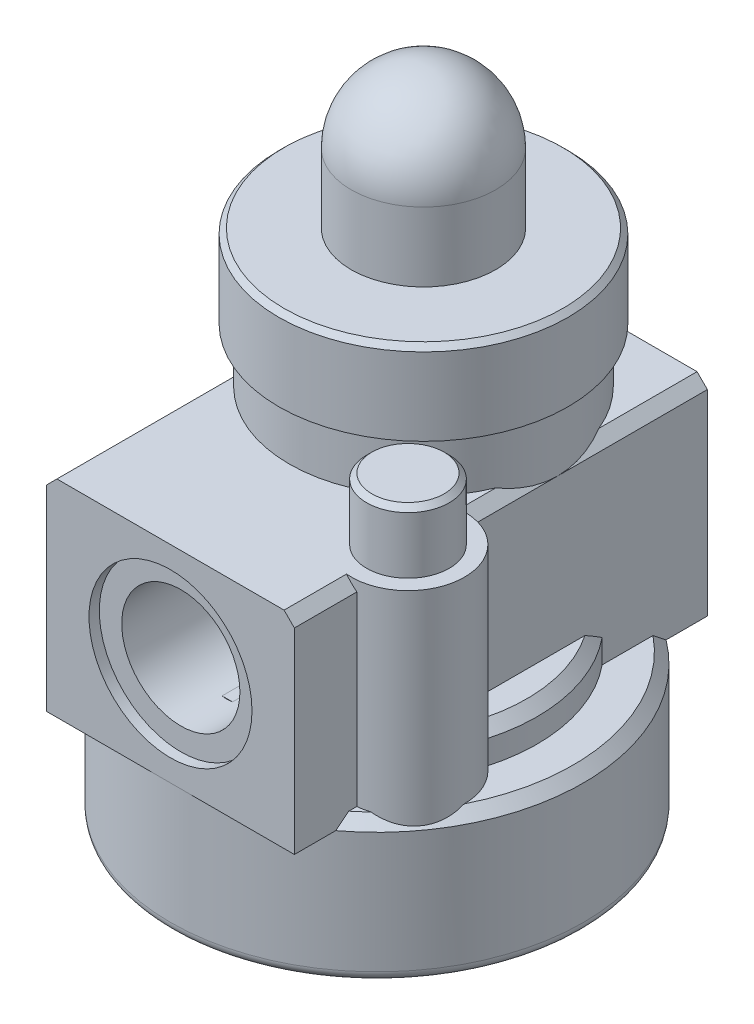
ISO-10303-21;
HEADER;
FILE_DESCRIPTION(('STEP AP214'),'2;1');
FILE_NAME('part.step','',(''),(''),'','','');
FILE_SCHEMA(('AUTOMOTIVE_DESIGN { 1 0 10303 214 1 1 1 1 }'));
ENDSEC;
DATA;
#1=APPLICATION_CONTEXT('core data for automotive mechanical design processes');
#2=APPLICATION_PROTOCOL_DEFINITION('international standard','automotive_design',2000,#1);
#3=PRODUCT_CONTEXT('',#1,'mechanical');
#4=PRODUCT('Part','Part','',(#3));
#5=PRODUCT_RELATED_PRODUCT_CATEGORY('part','',(#4));
#6=PRODUCT_DEFINITION_FORMATION('','',#4);
#7=PRODUCT_DEFINITION_CONTEXT('part definition',#1,'design');
#8=PRODUCT_DEFINITION('design','',#6,#7);
#9=PRODUCT_DEFINITION_SHAPE('','',#8);
#10=(LENGTH_UNIT() NAMED_UNIT(*) SI_UNIT(.MILLI.,.METRE.));
#11=(NAMED_UNIT(*) PLANE_ANGLE_UNIT() SI_UNIT($,.RADIAN.));
#12=(NAMED_UNIT(*) SI_UNIT($,.STERADIAN.) SOLID_ANGLE_UNIT());
#13=UNCERTAINTY_MEASURE_WITH_UNIT(LENGTH_MEASURE(1.E-05),#10,'distance_accuracy_value','');
#14=(GEOMETRIC_REPRESENTATION_CONTEXT(3) GLOBAL_UNCERTAINTY_ASSIGNED_CONTEXT((#13)) GLOBAL_UNIT_ASSIGNED_CONTEXT((#10,
#11,#12)) REPRESENTATION_CONTEXT('',''));
#15=CARTESIAN_POINT('',(0.,0.,0.));
#16=DIRECTION('',(0.,0.,1.));
#17=DIRECTION('',(1.,0.,0.));
#18=AXIS2_PLACEMENT_3D('',#15,#16,#17);
#19=CARTESIAN_POINT('',(-12.,31.7,20.));
#20=DIRECTION('',(1.,0.,0.));
#21=DIRECTION('',(0.,0.,-1.));
#22=AXIS2_PLACEMENT_3D('',#19,#20,#21);
#23=PLANE('',#22);
#24=CARTESIAN_POINT('',(-12.,19.3847243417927,-5.77031765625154));
#25=CARTESIAN_POINT('',(-12.,19.2900083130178,-5.98884736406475));
#26=CARTESIAN_POINT('',(-12.,19.1916472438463,-6.20576834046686));
#27=CARTESIAN_POINT('',(-12.,18.9884374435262,-6.63649740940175));
#28=CARTESIAN_POINT('',(-12.,18.8835901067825,-6.85030615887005));
#29=CARTESIAN_POINT('',(-12.,18.6682767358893,-7.27479633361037));
#30=CARTESIAN_POINT('',(-12.,18.5578164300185,-7.48548067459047));
#31=CARTESIAN_POINT('',(-12.,18.3318345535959,-7.90412624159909));
#32=CARTESIAN_POINT('',(-12.,18.2163126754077,-8.11208730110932));
#33=CARTESIAN_POINT('',(-12.,17.8638006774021,-8.73084677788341));
#34=CARTESIAN_POINT('',(-12.,17.6201709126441,-9.13787035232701));
#35=CARTESIAN_POINT('',(-12.,17.1189221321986,-9.9433040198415));
#36=CARTESIAN_POINT('',(-12.,16.8612989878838,-10.3417115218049));
#37=CARTESIAN_POINT('',(-12.,16.3362519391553,-11.1291461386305));
#38=CARTESIAN_POINT('',(-12.,16.0688828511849,-11.5182099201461));
#39=CARTESIAN_POINT('',(-12.,15.5252716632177,-12.2900909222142));
#40=CARTESIAN_POINT('',(-12.,15.249029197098,-12.6729078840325));
#41=CARTESIAN_POINT('',(-12.,14.6890682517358,-13.4335383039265));
#42=CARTESIAN_POINT('',(-12.,14.405343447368,-13.811347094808));
#43=CARTESIAN_POINT('',(-12.,13.8319096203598,-14.5624041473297));
#44=CARTESIAN_POINT('',(-12.,13.5422004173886,-14.9356522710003));
#45=CARTESIAN_POINT('',(-12.,12.8909709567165,-15.7631506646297));
#46=CARTESIAN_POINT('',(-12.,12.5281819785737,-16.216401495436));
#47=CARTESIAN_POINT('',(-12.,11.7965180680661,-17.1179691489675));
#48=CARTESIAN_POINT('',(-12.,11.4276430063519,-17.5662858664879));
#49=CARTESIAN_POINT('',(-12.,10.6848771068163,-18.4587875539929));
#50=CARTESIAN_POINT('',(-12.,10.3109859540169,-18.9029722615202));
#51=CARTESIAN_POINT('',(-12.,9.55906081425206,-19.7878101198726));
#52=CARTESIAN_POINT('',(-12.,9.18102686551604,-20.2284633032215));
#53=CARTESIAN_POINT('',(-12.,8.41947021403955,-21.1090799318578));
#54=CARTESIAN_POINT('',(-12.,8.03592905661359,-21.5490274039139));
#55=CARTESIAN_POINT('',(-12.,7.26588795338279,-22.4262831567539));
#56=CARTESIAN_POINT('',(-12.,6.87938816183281,-22.8635915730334));
#57=CARTESIAN_POINT('',(-12.,6.10379277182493,-23.7360105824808));
#58=CARTESIAN_POINT('',(-12.,5.71469681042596,-24.17112085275));
#59=CARTESIAN_POINT('',(-12.,4.93428814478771,-25.039382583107));
#60=CARTESIAN_POINT('',(-12.,4.54297534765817,-25.4725339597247));
#61=CARTESIAN_POINT('',(-12.,4.15073277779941,-25.9048385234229));
#62=B_SPLINE_CURVE_WITH_KNOTS('',3,(#24,#25,#26,#27,#28,#29,#30,#31,#32,#33,#34,#35,#36,#37,#38,
#39,#40,#41,#42,#43,#44,#45,#46,#47,#48,#49,#50,#51,#52,#53,#54,#55,#56,#57,#58,#59,#60,#61),
.UNSPECIFIED.,.F.,.F.,(4,2,2,2,2,2,2,2,2,2,2,2,2,2,2,2,2,2,4),(0.,0.714446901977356,
1.42874074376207,2.14231971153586,2.85594211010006,4.27864131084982,5.70176257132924,
7.11784050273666,8.53397693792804,9.95135150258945,11.3687688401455,13.1103870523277,
14.8520423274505,16.5938074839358,18.335556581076,20.0865173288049,21.8373873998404,
23.5885075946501,25.3397017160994),.UNSPECIFIED.);
#63=CARTESIAN_POINT('',(-12.,13.7,-14.7309198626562));
#64=VERTEX_POINT('',#63);
#65=CARTESIAN_POINT('',(-12.,12.7,-16.));
#66=VERTEX_POINT('',#65);
#67=EDGE_CURVE('E57',#64,#66,#62,.T.);
#68=ORIENTED_EDGE('',*,*,#67,.F.);
#69=DIRECTION('',(0.,0.,-1.));
#70=VECTOR('',#69,1.);
#71=CARTESIAN_POINT('',(-12.,13.7,20.));
#72=LINE('',#71,#70);
#73=CARTESIAN_POINT('',(-12.,13.7,-12.4282032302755));
#74=VERTEX_POINT('',#73);
#75=EDGE_CURVE('E651',#74,#64,#72,.T.);
#76=ORIENTED_EDGE('',*,*,#75,.F.);
#77=DIRECTION('',(0.,1.,0.));
#78=VECTOR('',#77,1.);
#79=CARTESIAN_POINT('',(-12.,12.7,-12.4282032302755));
#80=LINE('',#79,#78);
#81=CARTESIAN_POINT('',(-12.,31.7,-12.4282032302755));
#82=VERTEX_POINT('',#81);
#83=EDGE_CURVE('E564',#82,#74,#80,.F.);
#84=ORIENTED_EDGE('',*,*,#83,.F.);
#85=DIRECTION('',(0.,0.,-1.));
#86=VECTOR('',#85,1.);
#87=CARTESIAN_POINT('',(-12.,31.7,20.));
#88=LINE('',#87,#86);
#89=CARTESIAN_POINT('',(-12.,31.7,-20.));
#90=VERTEX_POINT('',#89);
#91=EDGE_CURVE('E392',#82,#90,#88,.T.);
#92=ORIENTED_EDGE('',*,*,#91,.T.);
#93=DIRECTION('',(0.,-1.,0.));
#94=VECTOR('',#93,1.);
#95=CARTESIAN_POINT('',(-12.,31.7,-20.));
#96=LINE('',#95,#94);
#97=CARTESIAN_POINT('',(-12.,12.7,-20.));
#98=VERTEX_POINT('',#97);
#99=EDGE_CURVE('E534',#90,#98,#96,.T.);
#100=ORIENTED_EDGE('',*,*,#99,.T.);
#101=DIRECTION('',(0.,0.,-1.));
#102=VECTOR('',#101,1.);
#103=CARTESIAN_POINT('',(-12.,12.7,20.));
#104=LINE('',#103,#102);
#105=EDGE_CURVE('E393',#66,#98,#104,.T.);
#106=ORIENTED_EDGE('',*,*,#105,.F.);
#107=EDGE_LOOP('',(#68,#76,#84,#92,#100,#106));
#108=FACE_BOUND('',#107,.T.);
#109=ADVANCED_FACE('F37',(#108),#23,.F.);
#110=CARTESIAN_POINT('',(-12.,1.54058010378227,28.7560332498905));
#111=CARTESIAN_POINT('',(-12.,1.91983146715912,28.3450746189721));
#112=CARTESIAN_POINT('',(-12.,2.29844191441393,27.9335234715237));
#113=CARTESIAN_POINT('',(-12.,3.054188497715,27.1090654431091));
#114=CARTESIAN_POINT('',(-12.,3.43132462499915,26.6961585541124));
#115=CARTESIAN_POINT('',(-12.,4.18397941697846,25.8687640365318));
#116=CARTESIAN_POINT('',(-12.,4.55949784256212,25.4542761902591));
#117=CARTESIAN_POINT('',(-12.,5.30861318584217,24.6235701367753));
#118=CARTESIAN_POINT('',(-12.,5.68221010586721,24.2073519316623));
#119=CARTESIAN_POINT('',(-12.,6.79193667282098,22.9644672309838));
#120=CARTESIAN_POINT('',(-12.,7.52487419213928,22.1349374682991));
#121=CARTESIAN_POINT('',(-12.,8.61554336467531,20.8830714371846));
#122=CARTESIAN_POINT('',(-12.,8.97763484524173,20.4645311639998));
#123=CARTESIAN_POINT('',(-12.,9.69838094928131,19.6245034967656));
#124=CARTESIAN_POINT('',(-12.,10.0570356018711,19.2030161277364));
#125=CARTESIAN_POINT('',(-12.,10.6695152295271,18.4761723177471));
#126=CARTESIAN_POINT('',(-12.,10.9243292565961,18.1716492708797));
#127=CARTESIAN_POINT('',(-12.,11.4315612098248,17.5606241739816));
#128=CARTESIAN_POINT('',(-12.,11.6839791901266,17.2541221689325));
#129=CARTESIAN_POINT('',(-12.,12.1860920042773,16.6388710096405));
#130=CARTESIAN_POINT('',(-12.,12.4357867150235,16.3301217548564));
#131=CARTESIAN_POINT('',(-12.,12.9320469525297,15.7100770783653));
#132=CARTESIAN_POINT('',(-12.,13.1786122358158,15.3987814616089));
#133=CARTESIAN_POINT('',(-12.,13.6705244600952,14.770226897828));
#134=CARTESIAN_POINT('',(-12.,13.915835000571,14.452939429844));
#135=CARTESIAN_POINT('',(-12.,14.4021051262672,13.8150489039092));
#136=CARTESIAN_POINT('',(-12.,14.6430647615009,13.4944458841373));
#137=CARTESIAN_POINT('',(-12.,15.1198443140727,12.8494765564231));
#138=CARTESIAN_POINT('',(-12.,15.3556646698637,12.5251105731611));
#139=CARTESIAN_POINT('',(-12.,15.8212218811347,11.872051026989));
#140=CARTESIAN_POINT('',(-12.,16.0509589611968,11.543357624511));
#141=CARTESIAN_POINT('',(-12.,16.5075003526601,10.8746444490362));
#142=CARTESIAN_POINT('',(-12.,16.7341639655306,10.5345283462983));
#143=CARTESIAN_POINT('',(-12.,17.1783475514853,9.84835493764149));
#144=CARTESIAN_POINT('',(-12.,17.3958674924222,9.50229761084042));
#145=CARTESIAN_POINT('',(-12.,17.8200066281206,8.80293266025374));
#146=CARTESIAN_POINT('',(-12.,18.0266115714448,8.4496163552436));
#147=CARTESIAN_POINT('',(-12.,18.4260313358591,7.73523713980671));
#148=CARTESIAN_POINT('',(-12.,18.618846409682,7.37417437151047));
#149=CARTESIAN_POINT('',(-12.,18.9848004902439,6.64856665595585));
#150=CARTESIAN_POINT('',(-12.,19.1581798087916,6.28414375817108));
#151=CARTESIAN_POINT('',(-12.,19.4844858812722,5.54611149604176));
#152=CARTESIAN_POINT('',(-12.,19.6374098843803,5.17250090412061));
#153=CARTESIAN_POINT('',(-12.,19.9177512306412,4.41685247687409));
#154=CARTESIAN_POINT('',(-12.,20.0452352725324,4.03483967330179));
#155=CARTESIAN_POINT('',(-12.,20.2699904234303,3.26213929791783));
#156=CARTESIAN_POINT('',(-12.,20.3672791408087,2.87145692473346));
#157=CARTESIAN_POINT('',(-12.,20.5250287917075,2.09110709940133));
#158=CARTESIAN_POINT('',(-12.,20.5862165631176,1.70158891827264));
#159=CARTESIAN_POINT('',(-12.,20.6711966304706,0.918429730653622));
#160=CARTESIAN_POINT('',(-12.,20.6949901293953,0.524788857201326));
#161=CARTESIAN_POINT('',(-12.,20.7035832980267,-0.263106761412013));
#162=CARTESIAN_POINT('',(-12.,20.6883655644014,-0.657361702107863));
#163=CARTESIAN_POINT('',(-12.,20.6199439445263,-1.44253133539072));
#164=CARTESIAN_POINT('',(-12.,20.5667350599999,-1.83344558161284));
#165=CARTESIAN_POINT('',(-12.,20.4094645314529,-2.69751399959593));
#166=CARTESIAN_POINT('',(-12.,20.2965609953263,-3.16904878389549));
#167=CARTESIAN_POINT('',(-12.,20.0269530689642,-4.09938622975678));
#168=CARTESIAN_POINT('',(-12.,19.8702240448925,-4.55818157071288));
#169=CARTESIAN_POINT('',(-12.,19.5210126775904,-5.46458118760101));
#170=CARTESIAN_POINT('',(-12.,19.3283427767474,-5.91211209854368));
#171=CARTESIAN_POINT('',(-12.,18.9156668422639,-6.79409951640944));
#172=CARTESIAN_POINT('',(-12.,18.6956672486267,-7.22855907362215));
#173=CARTESIAN_POINT('',(-12.,18.2744212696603,-8.01164550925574));
#174=CARTESIAN_POINT('',(-12.,18.0765339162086,-8.36209715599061));
#175=CARTESIAN_POINT('',(-12.,17.7717067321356,-8.88106350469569));
#176=CARTESIAN_POINT('',(-12.,17.669221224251,-9.05221412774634));
#177=CARTESIAN_POINT('',(-12.,17.4616168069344,-9.39289813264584));
#178=CARTESIAN_POINT('',(-12.,17.3564980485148,-9.56243160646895));
#179=CARTESIAN_POINT('',(-12.,17.2501916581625,-9.73121666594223));
#180=B_SPLINE_CURVE_WITH_KNOTS('',3,(#110,#111,#112,#113,#114,#115,#116,#117,#118,#119,#120,
#121,#122,#123,#124,#125,#126,#127,#128,#129,#130,#131,#132,#133,#134,#135,#136,#137,#138,#139,
#140,#141,#142,#143,#144,#145,#146,#147,#148,#149,#150,#151,#152,#153,#154,#155,#156,#157,#158,
#159,#160,#161,#162,#163,#164,#165,#166,#167,#168,#169,#170,#171,#172,#173,#174,#175,#176,#177,
#178,#179),.UNSPECIFIED.,.F.,.F.,(4,2,2,2,2,2,2,2,2,2,2,2,2,2,2,2,2,2,2,2,2,2,2,2,2,2,2,2,2,2,2,
2,2,2,4),(0.,1.67763778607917,3.35528552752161,5.03317327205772,6.71105898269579,
10.0317815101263,11.6920617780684,13.3523279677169,14.5435273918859,15.7346998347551,
16.9259259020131,18.1172440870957,19.3203900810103,20.5235222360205,21.7265513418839,
22.9295359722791,24.1555870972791,25.3816425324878,26.6092611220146,27.8368572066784,
29.047039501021,30.2573843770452,31.4645130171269,32.6709363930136,33.8521590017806,
35.0333436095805,36.2150552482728,37.3969223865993,38.8488547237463,40.3016048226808,
41.7621596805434,43.222371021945,44.4294835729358,45.0279298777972,45.6263419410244),.UNSPECIFIED.);
#181=CARTESIAN_POINT('',(-12.,12.7,16.));
#182=VERTEX_POINT('',#181);
#183=CARTESIAN_POINT('',(-12.,13.7,14.7309198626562));
#184=VERTEX_POINT('',#183);
#185=EDGE_CURVE('E361',#182,#184,#180,.T.);
#186=ORIENTED_EDGE('',*,*,#185,.F.);
#187=CARTESIAN_POINT('',(-12.,12.7,20.));
#188=VERTEX_POINT('',#187);
#189=EDGE_CURVE('E380',#188,#182,#104,.T.);
#190=ORIENTED_EDGE('',*,*,#189,.F.);
#191=DIRECTION('',(0.,-1.,0.));
#192=VECTOR('',#191,1.);
#193=CARTESIAN_POINT('',(-12.,31.7,20.));
#194=LINE('',#193,#192);
#195=CARTESIAN_POINT('',(-12.,31.7,20.));
#196=VERTEX_POINT('',#195);
#197=EDGE_CURVE('E516',#196,#188,#194,.T.);
#198=ORIENTED_EDGE('',*,*,#197,.F.);
#199=CARTESIAN_POINT('',(-12.,31.7,1.42820323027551));
#200=VERTEX_POINT('',#199);
#201=EDGE_CURVE('E487',#196,#200,#88,.T.);
#202=ORIENTED_EDGE('',*,*,#201,.T.);
#203=DIRECTION('',(0.,1.,0.));
#204=VECTOR('',#203,1.);
#205=CARTESIAN_POINT('',(-12.,12.7,1.42820323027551));
#206=LINE('',#205,#204);
#207=CARTESIAN_POINT('',(-12.,17.,1.42820323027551));
#208=VERTEX_POINT('',#207);
#209=EDGE_CURVE('E561',#208,#200,#206,.T.);
#210=ORIENTED_EDGE('',*,*,#209,.F.);
#211=DIRECTION('',(0.,0.,-1.));
#212=VECTOR('',#211,1.);
#213=CARTESIAN_POINT('',(-12.,17.,20.));
#214=LINE('',#213,#212);
#215=CARTESIAN_POINT('',(-12.,17.,8.13941029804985));
#216=VERTEX_POINT('',#215);
#217=EDGE_CURVE('E433',#216,#208,#214,.T.);
#218=ORIENTED_EDGE('',*,*,#217,.F.);
#219=CARTESIAN_POINT('',(-12.,7.53542954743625,20.7436890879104));
#220=CARTESIAN_POINT('',(-12.,7.80138874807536,20.4364216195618));
#221=CARTESIAN_POINT('',(-12.,8.06651434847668,20.1284299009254));
#222=CARTESIAN_POINT('',(-12.,8.59485417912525,19.5108027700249));
#223=CARTESIAN_POINT('',(-12.,8.8580683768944,19.2011673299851));
#224=CARTESIAN_POINT('',(-12.,9.38245875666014,18.579918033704));
#225=CARTESIAN_POINT('',(-12.,9.64363389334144,18.2683032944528));
#226=CARTESIAN_POINT('',(-12.,10.1635090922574,17.6430166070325));
#227=CARTESIAN_POINT('',(-12.,10.4222091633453,17.3293446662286));
#228=CARTESIAN_POINT('',(-12.,10.9430513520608,16.691994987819));
#229=CARTESIAN_POINT('',(-12.,11.2051233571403,16.3682599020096));
#230=CARTESIAN_POINT('',(-12.,11.7258147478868,15.718025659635));
#231=CARTESIAN_POINT('',(-12.,11.9844341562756,15.3915265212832));
#232=CARTESIAN_POINT('',(-12.,12.4975841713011,14.7354532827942));
#233=CARTESIAN_POINT('',(-12.,12.7521157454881,14.4058799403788));
#234=CARTESIAN_POINT('',(-12.,13.2564454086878,13.7431262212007));
#235=CARTESIAN_POINT('',(-12.,13.5062435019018,13.4099458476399));
#236=CARTESIAN_POINT('',(-12.,14.0005853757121,12.7389584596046));
#237=CARTESIAN_POINT('',(-12.,14.2451210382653,12.4011454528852));
#238=CARTESIAN_POINT('',(-12.,14.727463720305,11.7207323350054));
#239=CARTESIAN_POINT('',(-12.,14.9652706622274,11.3781321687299));
#240=CARTESIAN_POINT('',(-12.,15.4329664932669,10.6871106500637));
#241=CARTESIAN_POINT('',(-12.,15.6628481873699,10.3386844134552));
#242=CARTESIAN_POINT('',(-12.,16.1126911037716,9.63547255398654));
#243=CARTESIAN_POINT('',(-12.,16.3326525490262,9.28068707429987));
#244=CARTESIAN_POINT('',(-12.,16.7585235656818,8.56693888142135));
#245=CARTESIAN_POINT('',(-12.,16.9645390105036,8.20803963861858));
#246=CARTESIAN_POINT('',(-12.,17.3617985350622,7.48205018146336));
#247=CARTESIAN_POINT('',(-12.,17.5530408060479,7.11495897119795));
#248=CARTESIAN_POINT('',(-12.,17.9168718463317,6.37228350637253));
#249=CARTESIAN_POINT('',(-12.,18.0894891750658,5.99671335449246));
#250=CARTESIAN_POINT('',(-12.,18.4119483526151,5.23599839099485));
#251=CARTESIAN_POINT('',(-12.,18.5617993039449,4.85085747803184));
#252=CARTESIAN_POINT('',(-12.,18.8330528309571,4.0723482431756));
#253=CARTESIAN_POINT('',(-12.,18.9545706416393,3.6790205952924));
#254=CARTESIAN_POINT('',(-12.,19.164377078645,2.88350655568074));
#255=CARTESIAN_POINT('',(-12.,19.2526695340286,2.48132119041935));
#256=CARTESIAN_POINT('',(-12.,19.3905779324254,1.67215916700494));
#257=CARTESIAN_POINT('',(-12.,19.4403703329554,1.26521315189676));
#258=CARTESIAN_POINT('',(-12.,19.4985338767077,0.448359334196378));
#259=CARTESIAN_POINT('',(-12.,19.5069101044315,0.0384519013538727));
#260=CARTESIAN_POINT('',(-12.,19.4816181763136,-0.7805937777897));
#261=CARTESIAN_POINT('',(-12.,19.4478928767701,-1.1897302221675));
#262=CARTESIAN_POINT('',(-12.,19.3407056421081,-2.00275498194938));
#263=CARTESIAN_POINT('',(-12.,19.2672344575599,-2.40664205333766));
#264=CARTESIAN_POINT('',(-12.,19.0846141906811,-3.2086382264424));
#265=CARTESIAN_POINT('',(-12.,18.9752566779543,-3.60669903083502));
#266=CARTESIAN_POINT('',(-12.,18.7265648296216,-4.3931656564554));
#267=CARTESIAN_POINT('',(-12.,18.5872339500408,-4.78157258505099));
#268=CARTESIAN_POINT('',(-12.,18.3091906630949,-5.48487822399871));
#269=CARTESIAN_POINT('',(-12.,18.1742139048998,-5.80127767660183));
#270=CARTESIAN_POINT('',(-12.,17.8910686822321,-6.42488340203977));
#271=CARTESIAN_POINT('',(-12.,17.743022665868,-6.73214509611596));
#272=CARTESIAN_POINT('',(-12.,17.5891961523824,-7.03636722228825));
#273=B_SPLINE_CURVE_WITH_KNOTS('',3,(#219,#220,#221,#222,#223,#224,#225,#226,#227,#228,#229,
#230,#231,#232,#233,#234,#235,#236,#237,#238,#239,#240,#241,#242,#243,#244,#245,#246,#247,#248,
#249,#250,#251,#252,#253,#254,#255,#256,#257,#258,#259,#260,#261,#262,#263,#264,#265,#266,#267,
#268,#269,#270,#271,#272),.UNSPECIFIED.,.F.,.F.,(4,2,2,2,2,2,2,2,2,2,2,2,2,2,2,2,2,2,2,2,2,2,2,
2,2,2,4),(0.,1.21915221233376,2.43832509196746,3.65808659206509,4.87784372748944,
6.12737340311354,7.37689485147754,8.62611605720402,9.87533615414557,11.1263622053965,
12.37740267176,13.6295505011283,14.8816701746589,16.1228632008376,17.3642079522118,
18.6036213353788,19.8425378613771,21.0763240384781,22.3099679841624,23.5379236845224,
24.7657286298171,25.9952018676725,27.2249613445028,28.4619936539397,29.6988834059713,
30.7304788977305,31.7532681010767),.UNSPECIFIED.);
#274=CARTESIAN_POINT('',(-12.,16.,9.81070843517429));
#275=VERTEX_POINT('',#274);
#276=EDGE_CURVE('E315',#275,#216,#273,.T.);
#277=ORIENTED_EDGE('',*,*,#276,.F.);
#278=DIRECTION('',(0.,-1.,0.));
#279=VECTOR('',#278,1.);
#280=CARTESIAN_POINT('',(-12.,17.,9.81070843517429));
#281=LINE('',#280,#279);
#282=CARTESIAN_POINT('',(-12.,13.7,9.81070843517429));
#283=VERTEX_POINT('',#282);
#284=EDGE_CURVE('E470',#283,#275,#281,.F.);
#285=ORIENTED_EDGE('',*,*,#284,.F.);
#286=DIRECTION('',(0.,0.,-1.));
#287=VECTOR('',#286,1.);
#288=CARTESIAN_POINT('',(-12.,13.7,20.));
#289=LINE('',#288,#287);
#290=EDGE_CURVE('E65',#184,#283,#289,.T.);
#291=ORIENTED_EDGE('',*,*,#290,.F.);
#292=EDGE_LOOP('',(#186,#190,#198,#202,#210,#218,#277,#285,#291));
#293=FACE_BOUND('',#292,.T.);
#294=ADVANCED_FACE('F326',(#293),#23,.F.);
#295=CARTESIAN_POINT('',(12.,12.7,20.));
#296=DIRECTION('',(-1.,0.,0.));
#297=DIRECTION('',(0.,0.,1.));
#298=AXIS2_PLACEMENT_3D('',#295,#296,#297);
#299=PLANE('',#298);
#300=CARTESIAN_POINT('',(12.,-1.14193757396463,-31.6429571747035));
#301=CARTESIAN_POINT('',(12.,-0.684135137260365,-31.1533261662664));
#302=CARTESIAN_POINT('',(12.,-0.227031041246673,-30.663040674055));
#303=CARTESIAN_POINT('',(12.,0.685543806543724,-29.6809463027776));
#304=CARTESIAN_POINT('',(12.,1.14101454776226,-29.1891374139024));
#305=CARTESIAN_POINT('',(12.,2.05019123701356,-28.2036676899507));
#306=CARTESIAN_POINT('',(12.,2.50389672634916,-27.7100064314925));
#307=CARTESIAN_POINT('',(12.,3.40912565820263,-26.7206880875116));
#308=CARTESIAN_POINT('',(12.,3.86064910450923,-26.2250310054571));
#309=CARTESIAN_POINT('',(12.,4.76456065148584,-25.2276347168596));
#310=CARTESIAN_POINT('',(12.,5.21692932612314,-24.7258778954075));
#311=CARTESIAN_POINT('',(12.,6.11860559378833,-23.7196212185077));
#312=CARTESIAN_POINT('',(12.,6.5679131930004,-23.2151213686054));
#313=CARTESIAN_POINT('',(12.,7.46281317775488,-22.2029617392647));
#314=CARTESIAN_POINT('',(12.,7.90840607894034,-21.6953024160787));
#315=CARTESIAN_POINT('',(12.,8.79518743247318,-20.676150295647));
#316=CARTESIAN_POINT('',(12.,9.23637590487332,-20.1646575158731));
#317=CARTESIAN_POINT('',(12.,10.0315512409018,-19.232939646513));
#318=CARTESIAN_POINT('',(12.,10.3864490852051,-18.8134924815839));
#319=CARTESIAN_POINT('',(12.,11.0920030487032,-17.9710473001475));
#320=CARTESIAN_POINT('',(12.,11.4426592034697,-17.5480493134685));
#321=CARTESIAN_POINT('',(12.,12.1390109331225,-16.697719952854));
#322=CARTESIAN_POINT('',(12.,12.4847046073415,-16.2703870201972));
#323=CARTESIAN_POINT('',(12.,13.1698986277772,-15.4107834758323));
#324=CARTESIAN_POINT('',(12.,13.509399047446,-14.9785129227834));
#325=CARTESIAN_POINT('',(12.,14.1801720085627,-14.1088804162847));
#326=CARTESIAN_POINT('',(12.,14.5114584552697,-13.6715292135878));
#327=CARTESIAN_POINT('',(12.,15.1645937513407,-12.7897716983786));
#328=CARTESIAN_POINT('',(12.,15.4864420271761,-12.345364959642));
#329=CARTESIAN_POINT('',(12.,16.1179713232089,-11.4483669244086));
#330=CARTESIAN_POINT('',(12.,16.4276597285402,-10.9957808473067));
#331=CARTESIAN_POINT('',(12.,17.0316305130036,-10.0804839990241));
#332=CARTESIAN_POINT('',(12.,17.3259154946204,-9.61777495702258));
#333=CARTESIAN_POINT('',(12.,17.8502076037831,-8.75302067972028));
#334=CARTESIAN_POINT('',(12.,18.0830945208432,-8.35272921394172));
#335=CARTESIAN_POINT('',(12.,18.5307544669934,-7.54200230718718));
#336=CARTESIAN_POINT('',(12.,18.7455254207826,-7.13156571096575));
#337=CARTESIAN_POINT('',(12.,19.151787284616,-6.2996594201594));
#338=CARTESIAN_POINT('',(12.,19.3432978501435,-5.8781994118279));
#339=CARTESIAN_POINT('',(12.,19.6969342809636,-5.02305566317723));
#340=CARTESIAN_POINT('',(12.,19.8590677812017,-4.58937513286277));
#341=CARTESIAN_POINT('',(12.,20.1168627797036,-3.80054078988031));
#342=CARTESIAN_POINT('',(12.,20.2193371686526,-3.44762696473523));
#343=CARTESIAN_POINT('',(12.,20.3971103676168,-2.73496737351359));
#344=CARTESIAN_POINT('',(12.,20.472412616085,-2.37522247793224));
#345=CARTESIAN_POINT('',(12.,20.5921141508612,-1.65159500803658));
#346=CARTESIAN_POINT('',(12.,20.6365999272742,-1.28772695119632));
#347=CARTESIAN_POINT('',(12.,20.6925746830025,-0.557438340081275));
#348=CARTESIAN_POINT('',(12.,20.7040654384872,-0.191017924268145));
#349=CARTESIAN_POINT('',(12.,20.6933666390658,0.542112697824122));
#350=CARTESIAN_POINT('',(12.,20.6711044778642,0.908821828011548));
#351=CARTESIAN_POINT('',(12.,20.5940600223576,1.63878187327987));
#352=CARTESIAN_POINT('',(12.,20.5392749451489,2.00203248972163));
#353=CARTESIAN_POINT('',(12.,20.3998645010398,2.72382201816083));
#354=CARTESIAN_POINT('',(12.,20.3151490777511,3.08234328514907));
#355=CARTESIAN_POINT('',(12.,20.1197057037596,3.79213675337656));
#356=CARTESIAN_POINT('',(12.,20.0089770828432,4.14340876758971));
#357=CARTESIAN_POINT('',(12.,19.7490984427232,4.88489263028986));
#358=CARTESIAN_POINT('',(12.,19.5967837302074,5.27398649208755));
#359=CARTESIAN_POINT('',(12.,19.2690710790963,6.04241139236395));
#360=CARTESIAN_POINT('',(12.,19.0936630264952,6.4217380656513));
#361=CARTESIAN_POINT('',(12.,18.724001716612,7.17183462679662));
#362=CARTESIAN_POINT('',(12.,18.5297166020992,7.54258869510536));
#363=CARTESIAN_POINT('',(12.,18.126231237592,8.27577198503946));
#364=CARTESIAN_POINT('',(12.,17.9170329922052,8.63820231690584));
#365=CARTESIAN_POINT('',(12.,17.4851520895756,9.35815573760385));
#366=CARTESIAN_POINT('',(12.,17.2623896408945,9.71563073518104));
#367=CARTESIAN_POINT('',(12.,16.8069232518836,10.4241794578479));
#368=CARTESIAN_POINT('',(12.,16.5742190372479,10.7752530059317));
#369=CARTESIAN_POINT('',(12.,16.1008766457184,11.4715301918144));
#370=CARTESIAN_POINT('',(12.,15.8602458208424,11.816738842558));
#371=CARTESIAN_POINT('',(12.,15.3722571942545,12.5023452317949));
#372=CARTESIAN_POINT('',(12.,15.1248995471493,12.8427430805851));
#373=CARTESIAN_POINT('',(12.,14.6403605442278,13.4980028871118));
#374=CARTESIAN_POINT('',(12.,14.4035232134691,13.8131197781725));
#375=CARTESIAN_POINT('',(12.,13.9256231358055,14.4401665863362));
#376=CARTESIAN_POINT('',(12.,13.6845600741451,14.7520962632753));
#377=CARTESIAN_POINT('',(12.,13.2015083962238,15.3697052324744));
#378=CARTESIAN_POINT('',(12.,12.9595593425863,15.6754155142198));
#379=CARTESIAN_POINT('',(12.,12.4725973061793,16.2843795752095));
#380=CARTESIAN_POINT('',(12.,12.2275843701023,16.5876333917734));
#381=CARTESIAN_POINT('',(12.,11.981266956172,16.8898164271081));
#382=B_SPLINE_CURVE_WITH_KNOTS('',3,(#300,#301,#302,#303,#304,#305,#306,#307,#308,#309,#310,
#311,#312,#313,#314,#315,#316,#317,#318,#319,#320,#321,#322,#323,#324,#325,#326,#327,#328,#329,
#330,#331,#332,#333,#334,#335,#336,#337,#338,#339,#340,#341,#342,#343,#344,#345,#346,#347,#348,
#349,#350,#351,#352,#353,#354,#355,#356,#357,#358,#359,#360,#361,#362,#363,#364,#365,#366,#367,
#368,#369,#370,#371,#372,#373,#374,#375,#376,#377,#378,#379,#380,#381),.UNSPECIFIED.,.F.,.F.,(4,
2,2,2,2,2,2,2,2,2,2,2,2,2,2,2,2,2,2,2,2,2,2,2,2,2,2,2,2,2,2,2,2,2,2,2,2,2,2,2,4),(0.,
2.01094463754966,4.02190225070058,6.03335151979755,8.04479729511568,10.0715023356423,
12.0982032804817,14.1246180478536,16.1510235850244,17.7993319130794,19.4476264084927,
21.0965362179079,22.7454264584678,24.3913027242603,26.0372787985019,27.6822392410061,
29.3269208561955,30.7158827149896,32.1050034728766,33.4929421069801,34.8805195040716,
35.9820783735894,37.0834977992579,38.1818132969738,39.2800696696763,40.3806918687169,
41.4814082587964,42.585465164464,43.6895505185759,44.9421511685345,46.195302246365,
47.4506061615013,48.7057416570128,49.9691501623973,51.2325935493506,52.4948963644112,
53.7571701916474,54.939718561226,56.12235539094,57.2919428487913,58.4615125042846),.UNSPECIFIED.);
#383=CARTESIAN_POINT('',(12.,12.7,-16.));
#384=VERTEX_POINT('',#383);
#385=CARTESIAN_POINT('',(12.,13.7,-14.7309198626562));
#386=VERTEX_POINT('',#385);
#387=EDGE_CURVE('E341',#384,#386,#382,.T.);
#388=ORIENTED_EDGE('',*,*,#387,.F.);
#389=DIRECTION('',(0.,0.,-1.));
#390=VECTOR('',#389,1.);
#391=CARTESIAN_POINT('',(12.,12.7,20.));
#392=LINE('',#391,#390);
#393=CARTESIAN_POINT('',(12.,12.7,-20.));
#394=VERTEX_POINT('',#393);
#395=EDGE_CURVE('E493',#384,#394,#392,.T.);
#396=ORIENTED_EDGE('',*,*,#395,.T.);
#397=DIRECTION('',(0.,1.,0.));
#398=VECTOR('',#397,1.);
#399=CARTESIAN_POINT('',(12.,12.7,-20.));
#400=LINE('',#399,#398);
#401=CARTESIAN_POINT('',(12.,31.7,-20.));
#402=VERTEX_POINT('',#401);
#403=EDGE_CURVE('E527',#394,#402,#400,.T.);
#404=ORIENTED_EDGE('',*,*,#403,.T.);
#405=DIRECTION('',(0.,0.,-1.));
#406=VECTOR('',#405,1.);
#407=CARTESIAN_POINT('',(12.,31.7,20.));
#408=LINE('',#407,#406);
#409=CARTESIAN_POINT('',(12.,31.7,-5.5));
#410=VERTEX_POINT('',#409);
#411=EDGE_CURVE('E498',#410,#402,#408,.T.);
#412=ORIENTED_EDGE('',*,*,#411,.F.);
#413=CARTESIAN_POINT('',(12.,31.7,3.04787885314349));
#414=VERTEX_POINT('',#413);
#415=EDGE_CURVE('E497',#414,#410,#408,.T.);
#416=ORIENTED_EDGE('',*,*,#415,.F.);
#417=DIRECTION('',(0.,-1.,0.));
#418=VECTOR('',#417,1.);
#419=CARTESIAN_POINT('',(12.,38.7,3.04787885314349));
#420=LINE('',#419,#418);
#421=CARTESIAN_POINT('',(12.,17.,3.04787885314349));
#422=VERTEX_POINT('',#421);
#423=EDGE_CURVE('E540',#422,#414,#420,.F.);
#424=ORIENTED_EDGE('',*,*,#423,.F.);
#425=DIRECTION('',(0.,0.,1.));
#426=VECTOR('',#425,1.);
#427=CARTESIAN_POINT('',(12.,17.,20.));
#428=LINE('',#427,#426);
#429=CARTESIAN_POINT('',(12.,17.,-8.13941029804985));
#430=VERTEX_POINT('',#429);
#431=EDGE_CURVE('E259',#430,#422,#428,.T.);
#432=ORIENTED_EDGE('',*,*,#431,.F.);
#433=CARTESIAN_POINT('',(12.,4.85491006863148,-23.7899310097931));
#434=CARTESIAN_POINT('',(12.,5.16789629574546,-23.4393690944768));
#435=CARTESIAN_POINT('',(12.,5.48011481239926,-23.0881195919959));
#436=CARTESIAN_POINT('',(12.,6.10278450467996,-22.3840503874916));
#437=CARTESIAN_POINT('',(12.,6.41323565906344,-22.0312306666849));
#438=CARTESIAN_POINT('',(12.,7.03225194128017,-21.3236963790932));
#439=CARTESIAN_POINT('',(12.,7.34081628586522,-20.9689811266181));
#440=CARTESIAN_POINT('',(12.,7.95564269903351,-20.2575616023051));
#441=CARTESIAN_POINT('',(12.,8.26190477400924,-19.9008573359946));
#442=CARTESIAN_POINT('',(12.,8.87627303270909,-19.1799146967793));
#443=CARTESIAN_POINT('',(12.,9.18433986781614,-18.8156427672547));
#444=CARTESIAN_POINT('',(12.,9.79729989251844,-18.084439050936));
#445=CARTESIAN_POINT('',(12.,10.102193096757,-17.7175072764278));
#446=CARTESIAN_POINT('',(12.,10.7081981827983,-16.9806639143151));
#447=CARTESIAN_POINT('',(12.,11.0093108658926,-16.6107529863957));
#448=CARTESIAN_POINT('',(12.,11.6071484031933,-15.8673990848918));
#449=CARTESIAN_POINT('',(12.,11.9038732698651,-15.4939561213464));
#450=CARTESIAN_POINT('',(12.,12.4779522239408,-14.7610191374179));
#451=CARTESIAN_POINT('',(12.,12.7555517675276,-14.401717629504));
#452=CARTESIAN_POINT('',(12.,13.30509693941,-13.6788036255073));
#453=CARTESIAN_POINT('',(12.,13.5770425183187,-13.3151910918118));
#454=CARTESIAN_POINT('',(12.,14.1143065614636,-12.5827012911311));
#455=CARTESIAN_POINT('',(12.,14.3796202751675,-12.2138205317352));
#456=CARTESIAN_POINT('',(12.,14.901935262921,-11.4702141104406));
#457=CARTESIAN_POINT('',(12.,15.1589367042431,-11.0954885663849));
#458=CARTESIAN_POINT('',(12.,15.6617367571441,-10.3406738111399));
#459=CARTESIAN_POINT('',(12.,15.9075750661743,-9.96061114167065));
#460=CARTESIAN_POINT('',(12.,16.3866718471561,-9.19254193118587));
#461=CARTESIAN_POINT('',(12.,16.6199289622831,-8.8045345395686));
#462=CARTESIAN_POINT('',(12.,17.0703491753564,-8.01984645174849));
#463=CARTESIAN_POINT('',(12.,17.2875310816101,-7.62317661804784));
#464=CARTESIAN_POINT('',(12.,17.7018769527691,-6.81958150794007));
#465=CARTESIAN_POINT('',(12.,17.8990473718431,-6.41265959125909));
#466=CARTESIAN_POINT('',(12.,18.2511317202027,-5.62536559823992));
#467=CARTESIAN_POINT('',(12.,18.4082642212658,-5.24599371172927));
#468=CARTESIAN_POINT('',(12.,18.6968330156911,-4.47748247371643));
#469=CARTESIAN_POINT('',(12.,18.8282693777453,-4.08834314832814));
#470=CARTESIAN_POINT('',(12.,19.0594065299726,-3.30278846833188));
#471=CARTESIAN_POINT('',(12.,19.1592668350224,-2.90642074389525));
#472=CARTESIAN_POINT('',(12.,19.3228491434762,-2.10622695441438));
#473=CARTESIAN_POINT('',(12.,19.3865764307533,-1.7024019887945));
#474=CARTESIAN_POINT('',(12.,19.4743737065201,-0.884826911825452));
#475=CARTESIAN_POINT('',(12.,19.4978943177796,-0.471016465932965));
#476=CARTESIAN_POINT('',(12.,19.5018338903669,0.356797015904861));
#477=CARTESIAN_POINT('',(12.,19.4822541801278,0.770800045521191));
#478=CARTESIAN_POINT('',(12.,19.4013183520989,1.59607061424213));
#479=CARTESIAN_POINT('',(12.,19.3398180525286,2.0073237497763));
#480=CARTESIAN_POINT('',(12.,19.1790586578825,2.82231367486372));
#481=CARTESIAN_POINT('',(12.,19.0797900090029,3.22604853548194));
#482=CARTESIAN_POINT('',(12.,18.8051236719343,4.17589569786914));
#483=CARTESIAN_POINT('',(12.,18.6151312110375,4.71777980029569));
#484=CARTESIAN_POINT('',(12.,18.2951082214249,5.51622444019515));
#485=CARTESIAN_POINT('',(12.,18.1825362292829,5.78009134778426));
#486=CARTESIAN_POINT('',(12.,17.9472573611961,6.30328535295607));
#487=CARTESIAN_POINT('',(12.,17.8245508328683,6.56261260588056));
#488=CARTESIAN_POINT('',(12.,17.5697921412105,7.07821952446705));
#489=CARTESIAN_POINT('',(12.,17.4376963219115,7.33447747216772));
#490=CARTESIAN_POINT('',(12.,17.1659223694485,7.84295549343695));
#491=CARTESIAN_POINT('',(12.,17.0262436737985,8.09517526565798));
#492=CARTESIAN_POINT('',(12.,16.7404181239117,8.59578224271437));
#493=CARTESIAN_POINT('',(12.,16.5942738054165,8.84417089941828));
#494=CARTESIAN_POINT('',(12.,16.296344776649,9.33754654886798));
#495=CARTESIAN_POINT('',(12.,16.1445598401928,9.58253340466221));
#496=CARTESIAN_POINT('',(12.,15.7503952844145,10.2047063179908));
#497=CARTESIAN_POINT('',(12.,15.5045477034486,10.5796958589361));
#498=CARTESIAN_POINT('',(12.,15.0033285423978,11.3232287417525));
#499=CARTESIAN_POINT('',(12.,14.7479568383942,11.691771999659));
#500=CARTESIAN_POINT('',(12.,14.2329371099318,12.4183833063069));
#501=CARTESIAN_POINT('',(12.,13.9733936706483,12.7765256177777));
#502=CARTESIAN_POINT('',(12.,13.5794056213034,13.3102241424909));
#503=CARTESIAN_POINT('',(12.,13.4473096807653,13.487521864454));
#504=CARTESIAN_POINT('',(12.,13.1816848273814,13.8410353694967));
#505=CARTESIAN_POINT('',(12.,13.0481559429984,14.0172511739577));
#506=CARTESIAN_POINT('',(12.,12.9139739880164,14.192968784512));
#507=B_SPLINE_CURVE_WITH_KNOTS('',3,(#433,#434,#435,#436,#437,#438,#439,#440,#441,#442,#443,
#444,#445,#446,#447,#448,#449,#450,#451,#452,#453,#454,#455,#456,#457,#458,#459,#460,#461,#462,
#463,#464,#465,#466,#467,#468,#469,#470,#471,#472,#473,#474,#475,#476,#477,#478,#479,#480,#481,
#482,#483,#484,#485,#486,#487,#488,#489,#490,#491,#492,#493,#494,#495,#496,#497,#498,#499,#500,
#501,#502,#503,#504,#505,#506),.UNSPECIFIED.,.F.,.F.,(4,2,2,2,2,2,2,2,2,2,2,2,2,2,2,2,2,2,2,2,2,
2,2,2,2,2,2,2,2,2,2,2,2,2,2,2,4),(0.,1.40985456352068,2.81972603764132,4.2301476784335,
5.64056540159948,7.07177070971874,8.50296941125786,9.9338594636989,11.3647454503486,
12.7268413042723,14.0889490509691,15.4520060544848,16.8150356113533,18.1727618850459,
19.5306342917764,20.8868919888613,22.2427108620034,23.4738340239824,24.7049538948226,
25.9297512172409,27.1543693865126,28.3955906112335,29.6367735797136,30.8822471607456,
32.1280360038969,33.8474692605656,34.7079614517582,35.5684241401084,36.4331886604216,
37.2980174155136,38.1625099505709,39.0270371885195,40.3720257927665,41.7170319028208,
43.0438427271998,43.7071275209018,44.3703991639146),.UNSPECIFIED.);
#508=CARTESIAN_POINT('',(12.,16.,-9.81070843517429));
#509=VERTEX_POINT('',#508);
#510=EDGE_CURVE('E309',#509,#430,#507,.T.);
#511=ORIENTED_EDGE('',*,*,#510,.F.);
#512=DIRECTION('',(0.,-1.,0.));
#513=VECTOR('',#512,1.);
#514=CARTESIAN_POINT('',(12.,17.,-9.81070843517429));
#515=LINE('',#514,#513);
#516=CARTESIAN_POINT('',(12.,13.7,-9.81070843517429));
#517=VERTEX_POINT('',#516);
#518=EDGE_CURVE('E645',#517,#509,#515,.F.);
#519=ORIENTED_EDGE('',*,*,#518,.F.);
#520=DIRECTION('',(0.,0.,1.));
#521=VECTOR('',#520,1.);
#522=CARTESIAN_POINT('',(12.,13.7,20.));
#523=LINE('',#522,#521);
#524=EDGE_CURVE('E659',#386,#517,#523,.T.);
#525=ORIENTED_EDGE('',*,*,#524,.F.);
#526=EDGE_LOOP('',(#388,#396,#404,#412,#416,#424,#432,#511,#519,#525));
#527=FACE_BOUND('',#526,.T.);
#528=ADVANCED_FACE('F320',(#527),#299,.F.);
#529=CARTESIAN_POINT('',(12.,19.5621864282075,5.34809736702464));
#530=CARTESIAN_POINT('',(12.,19.4721819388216,5.56916530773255));
#531=CARTESIAN_POINT('',(12.,19.3782172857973,5.78858803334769));
#532=CARTESIAN_POINT('',(12.,19.1832373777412,6.22421828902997));
#533=CARTESIAN_POINT('',(12.,19.0822238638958,6.4404265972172));
#534=CARTESIAN_POINT('',(12.,18.8740916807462,6.8695627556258));
#535=CARTESIAN_POINT('',(12.,18.766980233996,7.08249412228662));
#536=CARTESIAN_POINT('',(12.,18.5472599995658,7.5055112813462));
#537=CARTESIAN_POINT('',(12.,18.434650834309,7.71559687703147));
#538=CARTESIAN_POINT('',(12.,18.0903919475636,8.34034457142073));
#539=CARTESIAN_POINT('',(12.,17.8515465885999,8.75105036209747));
#540=CARTESIAN_POINT('',(12.,17.3587374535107,9.56339610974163));
#541=CARTESIAN_POINT('',(12.,17.104768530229,9.96503291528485));
#542=CARTESIAN_POINT('',(12.,16.5863344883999,10.7582426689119));
#543=CARTESIAN_POINT('',(12.,16.3219360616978,11.1498593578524));
#544=CARTESIAN_POINT('',(12.,15.7836812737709,11.9264470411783));
#545=CARTESIAN_POINT('',(12.,15.5098259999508,12.3114187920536));
#546=CARTESIAN_POINT('',(12.,14.9541127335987,13.0761446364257));
#547=CARTESIAN_POINT('',(12.,14.6722466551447,13.4558928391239));
#548=CARTESIAN_POINT('',(12.,14.1021558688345,14.2105921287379));
#549=CARTESIAN_POINT('',(12.,13.8139309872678,14.5855430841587));
#550=CARTESIAN_POINT('',(12.,13.2340809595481,15.3289181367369));
#551=CARTESIAN_POINT('',(12.,12.9424897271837,15.6973687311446));
#552=CARTESIAN_POINT('',(12.,12.3549284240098,16.430766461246));
#553=CARTESIAN_POINT('',(12.,12.0589582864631,16.7957135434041));
#554=CARTESIAN_POINT('',(12.,11.4634423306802,17.5224060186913));
#555=CARTESIAN_POINT('',(12.,11.1638981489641,17.8841527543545));
#556=CARTESIAN_POINT('',(12.,10.5616430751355,18.6050011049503));
#557=CARTESIAN_POINT('',(12.,10.258932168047,18.9641027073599));
#558=CARTESIAN_POINT('',(12.,9.64924398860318,19.6818031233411));
#559=CARTESIAN_POINT('',(12.,9.34225286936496,20.0403901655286));
#560=CARTESIAN_POINT('',(12.,8.72588411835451,20.7555073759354));
#561=CARTESIAN_POINT('',(12.,8.41650648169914,21.1120375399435));
#562=CARTESIAN_POINT('',(12.,7.7955840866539,21.8233841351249));
#563=CARTESIAN_POINT('',(12.,7.48403873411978,22.178200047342));
#564=CARTESIAN_POINT('',(12.,6.8591193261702,22.8862106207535));
#565=CARTESIAN_POINT('',(12.,6.54574529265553,23.2394053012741));
#566=CARTESIAN_POINT('',(12.,6.23157863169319,23.5918911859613));
#567=B_SPLINE_CURVE_WITH_KNOTS('',3,(#529,#530,#531,#532,#533,#534,#535,#536,#537,#538,#539,
#540,#541,#542,#543,#544,#545,#546,#547,#548,#549,#550,#551,#552,#553,#554,#555,#556,#557,#558,
#559,#560,#561,#562,#563,#564,#565,#566),.UNSPECIFIED.,.F.,.F.,(4,2,2,2,2,2,2,2,2,2,2,2,2,2,2,2,
2,2,4),(0.,0.715980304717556,1.43178437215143,2.14675758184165,2.86177996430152,
4.28663824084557,5.71198425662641,7.12935381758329,8.54656094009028,9.96525326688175,
11.3839843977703,12.7935664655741,14.203170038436,15.6121512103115,17.0211390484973,
18.4372675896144,19.8533990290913,21.2699352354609,22.6864545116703),.UNSPECIFIED.);
#568=CARTESIAN_POINT('',(12.,13.7,14.7309198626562));
#569=VERTEX_POINT('',#568);
#570=CARTESIAN_POINT('',(12.,12.7,16.));
#571=VERTEX_POINT('',#570);
#572=EDGE_CURVE('E335',#569,#571,#567,.T.);
#573=ORIENTED_EDGE('',*,*,#572,.F.);
#574=DIRECTION('',(0.,0.,1.));
#575=VECTOR('',#574,1.);
#576=CARTESIAN_POINT('',(12.,13.7,20.));
#577=LINE('',#576,#575);
#578=CARTESIAN_POINT('',(12.,13.7,13.9521211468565));
#579=VERTEX_POINT('',#578);
#580=EDGE_CURVE('E656',#579,#569,#577,.T.);
#581=ORIENTED_EDGE('',*,*,#580,.F.);
#582=DIRECTION('',(0.,-1.,0.));
#583=VECTOR('',#582,1.);
#584=CARTESIAN_POINT('',(12.,38.7,13.9521211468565));
#585=LINE('',#584,#583);
#586=CARTESIAN_POINT('',(12.,31.7,13.9521211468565));
#587=VERTEX_POINT('',#586);
#588=EDGE_CURVE('E543',#587,#579,#585,.T.);
#589=ORIENTED_EDGE('',*,*,#588,.F.);
#590=CARTESIAN_POINT('',(12.,31.7,20.));
#591=VERTEX_POINT('',#590);
#592=EDGE_CURVE('E494',#591,#587,#408,.T.);
#593=ORIENTED_EDGE('',*,*,#592,.F.);
#594=DIRECTION('',(0.,1.,0.));
#595=VECTOR('',#594,1.);
#596=CARTESIAN_POINT('',(12.,12.7,20.));
#597=LINE('',#596,#595);
#598=CARTESIAN_POINT('',(12.,12.7,20.));
#599=VERTEX_POINT('',#598);
#600=EDGE_CURVE('E512',#599,#591,#597,.T.);
#601=ORIENTED_EDGE('',*,*,#600,.F.);
#602=EDGE_CURVE('E490',#599,#571,#392,.T.);
#603=ORIENTED_EDGE('',*,*,#602,.T.);
#604=EDGE_LOOP('',(#573,#581,#589,#593,#601,#603));
#605=FACE_BOUND('',#604,.T.);
#606=ADVANCED_FACE('F325',(#605),#299,.F.);
#607=CARTESIAN_POINT('',(-12.,12.7,20.));
#608=DIRECTION('',(0.,1.,0.));
#609=DIRECTION('',(0.,0.,1.));
#610=AXIS2_PLACEMENT_3D('',#607,#608,#609);
#611=PLANE('',#610);
#612=CARTESIAN_POINT('',(0.,12.7,0.));
#613=DIRECTION('',(0.,-1.,0.));
#614=DIRECTION('',(0.,0.,-1.));
#615=AXIS2_PLACEMENT_3D('',#612,#613,#614);
#616=CIRCLE('',#615,20.);
#617=CARTESIAN_POINT('',(0.,12.7,-20.));
#618=VERTEX_POINT('',#617);
#619=EDGE_CURVE('E399',#66,#618,#616,.T.);
#620=ORIENTED_EDGE('',*,*,#619,.F.);
#621=ORIENTED_EDGE('',*,*,#105,.T.);
#622=DIRECTION('',(1.,0.,0.));
#623=VECTOR('',#622,1.);
#624=CARTESIAN_POINT('',(-12.,12.7,-20.));
#625=LINE('',#624,#623);
#626=EDGE_CURVE('E530',#98,#618,#625,.T.);
#627=ORIENTED_EDGE('',*,*,#626,.T.);
#628=EDGE_LOOP('',(#620,#621,#627));
#629=FACE_BOUND('',#628,.T.);
#630=ADVANCED_FACE('F810',(#629),#611,.F.);
#631=EDGE_CURVE('E406',#618,#384,#616,.T.);
#632=ORIENTED_EDGE('',*,*,#631,.F.);
#633=EDGE_CURVE('E533',#618,#394,#625,.T.);
#634=ORIENTED_EDGE('',*,*,#633,.T.);
#635=ORIENTED_EDGE('',*,*,#395,.F.);
#636=EDGE_LOOP('',(#632,#634,#635));
#637=FACE_BOUND('',#636,.T.);
#638=ADVANCED_FACE('F814',(#637),#611,.F.);
#639=CARTESIAN_POINT('',(0.,12.7,20.));
#640=VERTEX_POINT('',#639);
#641=EDGE_CURVE('E388',#640,#182,#616,.T.);
#642=ORIENTED_EDGE('',*,*,#641,.F.);
#643=DIRECTION('',(1.,0.,0.));
#644=VECTOR('',#643,1.);
#645=CARTESIAN_POINT('',(-12.,12.7,20.));
#646=LINE('',#645,#644);
#647=EDGE_CURVE('E391',#188,#640,#646,.T.);
#648=ORIENTED_EDGE('',*,*,#647,.F.);
#649=ORIENTED_EDGE('',*,*,#189,.T.);
#650=EDGE_LOOP('',(#642,#648,#649));
#651=FACE_BOUND('',#650,.T.);
#652=ADVANCED_FACE('F386',(#651),#611,.F.);
#653=CARTESIAN_POINT('',(11.5,38.7,8.5));
#654=DIRECTION('',(0.,-1.,0.));
#655=DIRECTION('',(0.,0.,-1.));
#656=AXIS2_PLACEMENT_3D('',#653,#654,#655);
#657=CYLINDRICAL_SURFACE('',#656,5.475);
#658=CARTESIAN_POINT('',(11.5,13.7,8.5));
#659=DIRECTION('',(0.,-1.,0.));
#660=DIRECTION('',(0.,0.,-1.));
#661=AXIS2_PLACEMENT_3D('',#658,#659,#660);
#662=CIRCLE('',#661,5.475);
#663=CARTESIAN_POINT('',(13.1401771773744,13.7,13.7235470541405));
#664=VERTEX_POINT('',#663);
#665=EDGE_CURVE('E653',#664,#579,#662,.T.);
#666=ORIENTED_EDGE('',*,*,#665,.F.);
#667=CARTESIAN_POINT('',(16.9748883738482,13.7002,8.53496132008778));
#668=CARTESIAN_POINT('',(16.9740962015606,13.644358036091,8.66085460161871));
#669=CARTESIAN_POINT('',(16.9689310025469,13.5909263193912,8.78782805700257));
#670=CARTESIAN_POINT('',(16.9494850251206,13.4892836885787,9.04325040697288));
#671=CARTESIAN_POINT('',(16.935198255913,13.441076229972,9.1717002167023));
#672=CARTESIAN_POINT('',(16.8970669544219,13.3501836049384,9.42971500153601));
#673=CARTESIAN_POINT('',(16.8731860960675,13.3075202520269,9.5592823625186));
#674=CARTESIAN_POINT('',(16.8156175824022,13.2283744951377,9.81810610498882));
#675=CARTESIAN_POINT('',(16.7819319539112,13.1918908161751,9.94736254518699));
#676=CARTESIAN_POINT('',(16.7044477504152,13.1253582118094,10.2051508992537));
#677=CARTESIAN_POINT('',(16.6606062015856,13.0953377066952,10.333677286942));
#678=CARTESIAN_POINT('',(16.562907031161,13.0423018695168,10.5883473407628));
#679=CARTESIAN_POINT('',(16.5090500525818,13.0192860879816,10.7144911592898));
#680=CARTESIAN_POINT('',(16.3916250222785,12.9805995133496,10.9630224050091));
#681=CARTESIAN_POINT('',(16.3280771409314,12.9649137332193,11.0854170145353));
#682=CARTESIAN_POINT('',(16.1915598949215,12.9410349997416,11.3255912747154));
#683=CARTESIAN_POINT('',(16.118591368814,12.9328413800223,11.4433713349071));
#684=CARTESIAN_POINT('',(15.9693502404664,12.9243761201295,11.6649767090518));
#685=CARTESIAN_POINT('',(15.8936920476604,12.923577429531,11.7691965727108));
#686=CARTESIAN_POINT('',(15.7353000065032,12.9285406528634,11.9719454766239));
#687=CARTESIAN_POINT('',(15.6525663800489,12.9343023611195,12.0704746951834));
#688=CARTESIAN_POINT('',(15.4806520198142,12.9523197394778,12.2611866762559));
#689=CARTESIAN_POINT('',(15.3914681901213,12.9645785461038,12.3533663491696));
#690=CARTESIAN_POINT('',(15.2074389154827,12.9954443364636,12.5307385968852));
#691=CARTESIAN_POINT('',(15.1125935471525,13.0140512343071,12.6159312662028));
#692=CARTESIAN_POINT('',(14.9203013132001,13.0568943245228,12.7769763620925));
#693=CARTESIAN_POINT('',(14.8229659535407,13.0809898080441,12.8529997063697));
#694=CARTESIAN_POINT('',(14.6243792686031,13.1347923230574,12.9976635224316));
#695=CARTESIAN_POINT('',(14.5231263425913,13.1645016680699,13.0663009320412));
#696=CARTESIAN_POINT('',(14.3175574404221,13.2292194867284,13.1959295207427));
#697=CARTESIAN_POINT('',(14.2132430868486,13.2642251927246,13.2569246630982));
#698=CARTESIAN_POINT('',(14.0022245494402,13.3392371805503,13.3712318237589));
#699=CARTESIAN_POINT('',(13.8955201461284,13.3792439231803,13.4245431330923));
#700=CARTESIAN_POINT('',(13.6810379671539,13.4636882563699,13.5232011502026));
#701=CARTESIAN_POINT('',(13.5732696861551,13.5080994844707,13.5685912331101));
#702=CARTESIAN_POINT('',(13.3569844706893,13.6010899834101,13.6517611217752));
#703=CARTESIAN_POINT('',(13.2484703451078,13.6496576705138,13.6895611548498));
#704=CARTESIAN_POINT('',(13.1397468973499,13.7002,13.7236821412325));
#705=B_SPLINE_CURVE_WITH_KNOTS('',3,(#667,#668,#669,#670,#671,#672,#673,#674,#675,#676,#677,
#678,#679,#680,#681,#682,#683,#684,#685,#686,#687,#688,#689,#690,#691,#692,#693,#694,#695,#696,
#697,#698,#699,#700,#701,#702,#703,#704),.UNSPECIFIED.,.F.,.F.,(4,2,2,2,2,2,2,2,2,2,2,2,2,2,2,2,
2,2,4),(0.,0.413132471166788,0.826536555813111,1.24152088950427,1.65641949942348,
2.07310686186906,2.48976748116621,2.90557242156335,3.32134037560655,3.70722583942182,
4.09309920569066,4.47915902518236,4.86521362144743,5.24230614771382,5.61955441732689,
5.99660622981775,6.37369280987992,6.74864490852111,7.12258410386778),.UNSPECIFIED.);
#706=CARTESIAN_POINT('',(16.9748854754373,13.7,8.53541229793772));
#707=VERTEX_POINT('',#706);
#708=EDGE_CURVE('E11',#707,#664,#705,.T.);
#709=ORIENTED_EDGE('',*,*,#708,.F.);
#710=CARTESIAN_POINT('',(14.9144378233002,13.7,4.22013559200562));
#711=VERTEX_POINT('',#710);
#712=EDGE_CURVE('E657',#711,#707,#662,.T.);
#713=ORIENTED_EDGE('',*,*,#712,.F.);
#714=DIRECTION('',(0.,-1.,0.));
#715=VECTOR('',#714,1.);
#716=CARTESIAN_POINT('',(14.9144378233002,14.85,4.22013559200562));
#717=LINE('',#716,#715);
#718=CARTESIAN_POINT('',(14.9144378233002,16.,4.22013559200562));
#719=VERTEX_POINT('',#718);
#720=EDGE_CURVE('E643',#719,#711,#717,.T.);
#721=ORIENTED_EDGE('',*,*,#720,.F.);
#722=CARTESIAN_POINT('',(14.0337673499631,17.0002,3.64658388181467));
#723=CARTESIAN_POINT('',(14.1106568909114,16.915685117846,3.68672568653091));
#724=CARTESIAN_POINT('',(14.1867837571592,16.8313874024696,3.72879264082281));
#725=CARTESIAN_POINT('',(14.337272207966,16.663417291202,3.81672134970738));
#726=CARTESIAN_POINT('',(14.4116358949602,16.5797442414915,3.86257825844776));
#727=CARTESIAN_POINT('',(14.5585533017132,16.4130001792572,3.95813304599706));
#728=CARTESIAN_POINT('',(14.631107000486,16.3299291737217,4.00783096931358));
#729=CARTESIAN_POINT('',(14.7743339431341,16.1643744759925,4.11113157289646));
#730=CARTESIAN_POINT('',(14.8450047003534,16.0818916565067,4.16473909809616));
#731=CARTESIAN_POINT('',(14.9146073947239,15.9998,4.22027088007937));
#732=B_SPLINE_CURVE_WITH_KNOTS('',3,(#722,#723,#724,#725,#726,#727,#728,#729,#730,#731),
.UNSPECIFIED.,.F.,.F.,(4,2,2,2,4),(0.,0.363296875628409,0.726136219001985,1.08897976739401,
1.4522808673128),.UNSPECIFIED.);
#733=CARTESIAN_POINT('',(14.0339493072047,17.,3.64667887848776));
#734=VERTEX_POINT('',#733);
#735=EDGE_CURVE('E262',#734,#719,#732,.T.);
#736=ORIENTED_EDGE('',*,*,#735,.F.);
#737=CARTESIAN_POINT('',(11.5,17.,8.5));
#738=DIRECTION('',(0.,-1.,0.));
#739=DIRECTION('',(0.,0.,-1.));
#740=AXIS2_PLACEMENT_3D('',#737,#738,#739);
#741=CIRCLE('',#740,5.475);
#742=EDGE_CURVE('E265',#422,#734,#741,.T.);
#743=ORIENTED_EDGE('',*,*,#742,.F.);
#744=ORIENTED_EDGE('',*,*,#423,.T.);
#745=CARTESIAN_POINT('',(11.5,32.2,8.5));
#746=DIRECTION('',(-0.707106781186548,-0.707106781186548,0.));
#747=DIRECTION('',(0.707106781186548,-0.707106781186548,0.));
#748=AXIS2_PLACEMENT_3D('',#745,#746,#747);
#749=ELLIPSE('',#748,7.7428192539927,5.475);
#750=CARTESIAN_POINT('',(11.,32.7,3.04787885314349));
#751=VERTEX_POINT('',#750);
#752=EDGE_CURVE('E542',#414,#751,#749,.F.);
#753=ORIENTED_EDGE('',*,*,#752,.T.);
#754=CARTESIAN_POINT('',(11.5,32.7,8.5));
#755=DIRECTION('',(0.,-1.,0.));
#756=DIRECTION('',(0.,0.,-1.));
#757=AXIS2_PLACEMENT_3D('',#754,#755,#756);
#758=CIRCLE('',#757,5.475);
#759=CARTESIAN_POINT('',(11.,32.7,13.9521211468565));
#760=VERTEX_POINT('',#759);
#761=EDGE_CURVE('E549',#751,#760,#758,.T.);
#762=ORIENTED_EDGE('',*,*,#761,.T.);
#763=EDGE_CURVE('E546',#760,#587,#749,.F.);
#764=ORIENTED_EDGE('',*,*,#763,.T.);
#765=ORIENTED_EDGE('',*,*,#588,.T.);
#766=EDGE_LOOP('',(#666,#709,#713,#721,#736,#743,#744,#753,#762,#764,#765));
#767=FACE_BOUND('',#766,.T.);
#768=ADVANCED_FACE('F671',(#767),#657,.T.);
#769=CARTESIAN_POINT('',(-1.,12.7,-5.5));
#770=DIRECTION('',(0.,1.,0.));
#771=DIRECTION('',(0.,0.,1.));
#772=AXIS2_PLACEMENT_3D('',#769,#770,#771);
#773=CYLINDRICAL_SURFACE('',#772,13.);
#774=CARTESIAN_POINT('',(-1.,38.,-5.5));
#775=DIRECTION('',(0.,1.,0.));
#776=DIRECTION('',(0.,0.,1.));
#777=AXIS2_PLACEMENT_3D('',#774,#775,#776);
#778=CIRCLE('',#777,13.);
#779=CARTESIAN_POINT('',(-1.,38.,7.5));
#780=VERTEX_POINT('',#779);
#781=EDGE_CURVE('E589',#780,#780,#778,.T.);
#782=ORIENTED_EDGE('',*,*,#781,.F.);
#783=EDGE_LOOP('',(#782));
#784=FACE_BOUND('',#783,.T.);
#785=CARTESIAN_POINT('',(-1.,13.7,-5.5));
#786=DIRECTION('',(0.,-1.,0.));
#787=DIRECTION('',(0.,0.,-1.));
#788=AXIS2_PLACEMENT_3D('',#785,#786,#787);
#789=CIRCLE('',#788,13.);
#790=CARTESIAN_POINT('',(-13.9364059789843,13.7,-6.78428982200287));
#791=VERTEX_POINT('',#790);
#792=EDGE_CURVE('E50',#791,#74,#789,.T.);
#793=ORIENTED_EDGE('',*,*,#792,.F.);
#794=DIRECTION('',(0.,-1.,0.));
#795=VECTOR('',#794,1.);
#796=CARTESIAN_POINT('',(-13.9364059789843,14.85,-6.78428982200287));
#797=LINE('',#796,#795);
#798=CARTESIAN_POINT('',(-13.9364059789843,16.,-6.78428982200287));
#799=VERTEX_POINT('',#798);
#800=EDGE_CURVE('E472',#799,#791,#797,.T.);
#801=ORIENTED_EDGE('',*,*,#800,.F.);
#802=CARTESIAN_POINT('',(-7.35210055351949,22.1091841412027,5.84243441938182));
#803=CARTESIAN_POINT('',(-7.52677977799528,22.0332841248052,5.74460615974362));
#804=CARTESIAN_POINT('',(-7.69882950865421,21.9563515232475,5.64295453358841));
#805=CARTESIAN_POINT('',(-8.03747313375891,21.8007006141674,5.43223492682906));
#806=CARTESIAN_POINT('',(-8.2040674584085,21.7219824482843,5.32316753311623));
#807=CARTESIAN_POINT('',(-8.69525597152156,21.4836266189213,4.98527104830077));
#808=CARTESIAN_POINT('',(-9.0114234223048,21.3217143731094,4.74565348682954));
#809=CARTESIAN_POINT('',(-9.61952267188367,20.9938106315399,4.2396319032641));
#810=CARTESIAN_POINT('',(-9.91143992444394,20.8278167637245,3.97321201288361));
#811=CARTESIAN_POINT('',(-10.4692200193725,20.4934604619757,3.41567974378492));
#812=CARTESIAN_POINT('',(-10.7350813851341,20.3250978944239,3.12456596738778));
#813=CARTESIAN_POINT('',(-11.2416858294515,19.9856719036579,2.5166115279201));
#814=CARTESIAN_POINT('',(-11.4821390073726,19.8145985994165,2.19953484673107));
#815=CARTESIAN_POINT('',(-11.9330635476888,19.4727433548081,1.54458599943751));
#816=CARTESIAN_POINT('',(-12.1435348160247,19.3019614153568,1.20671376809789));
#817=CARTESIAN_POINT('',(-12.5326231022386,18.9620266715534,0.513029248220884));
#818=CARTESIAN_POINT('',(-12.711283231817,18.7928719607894,0.157242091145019));
#819=CARTESIAN_POINT('',(-13.0355248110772,18.4570112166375,-0.57002773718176));
#820=CARTESIAN_POINT('',(-13.1811170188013,18.2903044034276,-0.941505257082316));
#821=CARTESIAN_POINT('',(-13.4595964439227,17.9322758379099,-1.76152125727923));
#822=CARTESIAN_POINT('',(-13.5861845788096,17.7415522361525,-2.21247821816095));
#823=CARTESIAN_POINT('',(-13.7902405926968,17.3661030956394,-3.12739407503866));
#824=CARTESIAN_POINT('',(-13.8677456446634,17.1813731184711,-3.59134285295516));
#825=CARTESIAN_POINT('',(-13.9700562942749,16.8262563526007,-4.50894304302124));
#826=CARTESIAN_POINT('',(-13.9968413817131,16.6555913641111,-4.96226661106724));
#827=CARTESIAN_POINT('',(-14.0026325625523,16.3217627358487,-5.87234116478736));
#828=CARTESIAN_POINT('',(-13.9816125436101,16.1586032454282,-6.32909388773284));
#829=CARTESIAN_POINT('',(-13.9033041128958,15.8838649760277,-7.11760071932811));
#830=CARTESIAN_POINT('',(-13.8573379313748,15.7702517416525,-7.44981380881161));
#831=CARTESIAN_POINT('',(-13.7394488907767,15.5479956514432,-8.11138168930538));
#832=CARTESIAN_POINT('',(-13.6675218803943,15.439353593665,-8.44073601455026));
#833=CARTESIAN_POINT('',(-13.4976614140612,15.2273344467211,-9.09482439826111));
#834=CARTESIAN_POINT('',(-13.3996994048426,15.1239632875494,-9.41955296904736));
#835=CARTESIAN_POINT('',(-13.1780234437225,14.922986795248,-10.0619291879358));
#836=CARTESIAN_POINT('',(-13.0543094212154,14.8253814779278,-10.3795768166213));
#837=CARTESIAN_POINT('',(-12.7656995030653,14.6253370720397,-11.0419745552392));
#838=CARTESIAN_POINT('',(-12.5976933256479,14.5236476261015,-11.3856021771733));
#839=CARTESIAN_POINT('',(-12.2308820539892,14.3283661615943,-12.0585187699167));
#840=CARTESIAN_POINT('',(-12.0320706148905,14.2347758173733,-12.3878047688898));
#841=CARTESIAN_POINT('',(-11.6050808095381,14.0562882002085,-13.0286330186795));
#842=CARTESIAN_POINT('',(-11.3769395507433,13.9713801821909,-13.3401969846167));
#843=CARTESIAN_POINT('',(-10.892663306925,13.810595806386,-13.9430213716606));
#844=CARTESIAN_POINT('',(-10.6365425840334,13.7347148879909,-14.2342920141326));
#845=CARTESIAN_POINT('',(-10.1384296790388,13.603026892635,-14.7519198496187));
#846=CARTESIAN_POINT('',(-9.90007981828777,13.5459160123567,-14.9814608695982));
#847=CARTESIAN_POINT('',(-9.40608874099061,13.4387805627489,-15.4220576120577));
#848=CARTESIAN_POINT('',(-9.15047576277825,13.3887448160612,-15.633142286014));
#849=CARTESIAN_POINT('',(-8.88668619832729,13.3423029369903,-15.8344172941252));
#850=B_SPLINE_CURVE_WITH_KNOTS('',3,(#802,#803,#804,#805,#806,#807,#808,#809,#810,#811,#812,
#813,#814,#815,#816,#817,#818,#819,#820,#821,#822,#823,#824,#825,#826,#827,#828,#829,#830,#831,
#832,#833,#834,#835,#836,#837,#838,#839,#840,#841,#842,#843,#844,#845,#846,#847,#848,#849),
.UNSPECIFIED.,.F.,.F.,(4,2,2,2,2,2,2,2,2,2,2,2,2,2,2,2,2,2,2,2,2,2,2,4),(0.,0.642222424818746,
1.28439408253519,2.56812203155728,3.85261453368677,5.13717978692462,6.4351009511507,
7.73302618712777,9.02917880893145,10.3249091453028,11.8394856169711,13.3529136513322,
14.8059503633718,16.2597809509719,17.3211565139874,18.3827018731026,19.4454162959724,
20.5081336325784,21.6939459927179,22.8800029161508,24.0645737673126,25.2485435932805,
26.2549389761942,27.2597262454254),.UNSPECIFIED.);
#851=CARTESIAN_POINT('',(-13.92,17.,-4.06000000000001));
#852=VERTEX_POINT('',#851);
#853=EDGE_CURVE('E258',#852,#799,#850,.T.);
#854=ORIENTED_EDGE('',*,*,#853,.F.);
#855=CARTESIAN_POINT('',(-1.,17.,-5.5));
#856=DIRECTION('',(0.,-1.,0.));
#857=DIRECTION('',(0.,0.,-1.));
#858=AXIS2_PLACEMENT_3D('',#855,#856,#857);
#859=CIRCLE('',#858,13.);
#860=EDGE_CURVE('E247',#208,#852,#859,.T.);
#861=ORIENTED_EDGE('',*,*,#860,.F.);
#862=ORIENTED_EDGE('',*,*,#209,.T.);
#863=CARTESIAN_POINT('',(-1.,42.7,-5.5));
#864=DIRECTION('',(0.707106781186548,-0.707106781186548,0.));
#865=DIRECTION('',(0.707106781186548,0.707106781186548,0.));
#866=AXIS2_PLACEMENT_3D('',#863,#864,#865);
#867=ELLIPSE('',#866,18.3847763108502,13.);
#868=CARTESIAN_POINT('',(-11.,32.7,2.80662386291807));
#869=VERTEX_POINT('',#868);
#870=EDGE_CURVE('E563',#200,#869,#867,.F.);
#871=ORIENTED_EDGE('',*,*,#870,.T.);
#872=CARTESIAN_POINT('',(-1.,32.7,-5.5));
#873=DIRECTION('',(0.,-1.,0.));
#874=DIRECTION('',(0.,0.,-1.));
#875=AXIS2_PLACEMENT_3D('',#872,#873,#874);
#876=CIRCLE('',#875,13.);
#877=CARTESIAN_POINT('',(11.,32.7,-0.500000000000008));
#878=VERTEX_POINT('',#877);
#879=EDGE_CURVE('E478',#869,#878,#876,.F.);
#880=ORIENTED_EDGE('',*,*,#879,.T.);
#881=CARTESIAN_POINT('',(-1.,44.7,-5.5));
#882=DIRECTION('',(-0.707106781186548,-0.707106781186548,0.));
#883=DIRECTION('',(-0.707106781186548,0.707106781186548,0.));
#884=AXIS2_PLACEMENT_3D('',#881,#882,#883);
#885=ELLIPSE('',#884,18.3847763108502,13.);
#886=EDGE_CURVE('E567',#878,#410,#885,.F.);
#887=ORIENTED_EDGE('',*,*,#886,.T.);
#888=CARTESIAN_POINT('',(11.,32.7,-10.5));
#889=VERTEX_POINT('',#888);
#890=EDGE_CURVE('E568',#410,#889,#885,.F.);
#891=ORIENTED_EDGE('',*,*,#890,.T.);
#892=CARTESIAN_POINT('',(-11.,32.7,-13.8066238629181));
#893=VERTEX_POINT('',#892);
#894=EDGE_CURVE('E483',#889,#893,#876,.F.);
#895=ORIENTED_EDGE('',*,*,#894,.T.);
#896=EDGE_CURVE('E571',#893,#82,#867,.F.);
#897=ORIENTED_EDGE('',*,*,#896,.T.);
#898=ORIENTED_EDGE('',*,*,#83,.T.);
#899=EDGE_LOOP('',(#793,#801,#854,#861,#862,#871,#880,#887,#891,#895,#897,#898));
#900=FACE_BOUND('',#899,.T.);
#901=ADVANCED_FACE('F694',(#784,#900),#773,.T.);
#902=CARTESIAN_POINT('',(0.,22.7,-10.));
#903=DIRECTION('',(0.,0.,-1.));
#904=DIRECTION('',(-1.,0.,0.));
#905=AXIS2_PLACEMENT_3D('',#902,#903,#904);
#906=PLANE('',#905);
#907=CARTESIAN_POINT('',(0.,22.7,-10.));
#908=DIRECTION('',(0.,0.,1.));
#909=DIRECTION('',(1.,0.,0.));
#910=AXIS2_PLACEMENT_3D('',#907,#908,#909);
#911=CIRCLE('',#910,5.7225);
#912=CARTESIAN_POINT('',(0.506957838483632,17.,-10.));
#913=VERTEX_POINT('',#912);
#914=CARTESIAN_POINT('',(-0.506957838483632,17.,-10.));
#915=VERTEX_POINT('',#914);
#916=EDGE_CURVE('E592',#913,#915,#911,.T.);
#917=ORIENTED_EDGE('',*,*,#916,.F.);
#918=DIRECTION('',(-1.,0.,0.));
#919=VECTOR('',#918,1.);
#920=CARTESIAN_POINT('',(0.,17.,-10.));
#921=LINE('',#920,#919);
#922=EDGE_CURVE('E242',#913,#915,#921,.T.);
#923=ORIENTED_EDGE('',*,*,#922,.T.);
#924=EDGE_LOOP('',(#917,#923));
#925=FACE_BOUND('',#924,.T.);
#926=ADVANCED_FACE('F1175',(#925),#906,.T.);
#927=CARTESIAN_POINT('',(0.,22.7,-20.));
#928=DIRECTION('',(0.,0.,1.));
#929=DIRECTION('',(1.,0.,0.));
#930=AXIS2_PLACEMENT_3D('',#927,#928,#929);
#931=CYLINDRICAL_SURFACE('',#930,5.7225);
#932=CARTESIAN_POINT('',(0.,22.7,-19.));
#933=DIRECTION('',(0.,0.,1.));
#934=DIRECTION('',(1.,0.,0.));
#935=AXIS2_PLACEMENT_3D('',#932,#933,#934);
#936=CIRCLE('',#935,5.7225);
#937=CARTESIAN_POINT('',(5.7225,22.7,-19.));
#938=VERTEX_POINT('',#937);
#939=EDGE_CURVE('E594',#938,#938,#936,.T.);
#940=ORIENTED_EDGE('',*,*,#939,.F.);
#941=EDGE_LOOP('',(#940));
#942=FACE_BOUND('',#941,.T.);
#943=CARTESIAN_POINT('',(-0.53378857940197,17.00245,-14.4877198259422));
#944=CARTESIAN_POINT('',(-0.355859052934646,16.9858166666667,-14.5109066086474));
#945=CARTESIAN_POINT('',(-0.177929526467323,16.9775,-14.5225));
#946=CARTESIAN_POINT('',(0.177929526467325,16.9775,-14.5225));
#947=CARTESIAN_POINT('',(0.355859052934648,16.9858166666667,-14.5109066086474));
#948=CARTESIAN_POINT('',(0.533788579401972,17.00245,-14.4877198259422));
#949=B_SPLINE_CURVE_WITH_KNOTS('',3,(#943,#944,#945,#946,#947,#948),.UNSPECIFIED.,.F.,.F.,(4,2,
4),(0.,0.535502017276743,1.07100403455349),.UNSPECIFIED.);
#950=CARTESIAN_POINT('',(-0.506957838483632,17.,-14.4911350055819));
#951=VERTEX_POINT('',#950);
#952=CARTESIAN_POINT('',(0.506957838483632,17.,-14.4911350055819));
#953=VERTEX_POINT('',#952);
#954=EDGE_CURVE('E251',#951,#953,#949,.T.);
#955=ORIENTED_EDGE('',*,*,#954,.T.);
#956=DIRECTION('',(0.,0.,1.));
#957=VECTOR('',#956,1.);
#958=CARTESIAN_POINT('',(0.506957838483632,17.,-20.));
#959=LINE('',#958,#957);
#960=EDGE_CURVE('E236',#953,#913,#959,.T.);
#961=ORIENTED_EDGE('',*,*,#960,.T.);
#962=ORIENTED_EDGE('',*,*,#916,.T.);
#963=DIRECTION('',(0.,0.,1.));
#964=VECTOR('',#963,1.);
#965=CARTESIAN_POINT('',(-0.506957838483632,17.,-20.));
#966=LINE('',#965,#964);
#967=EDGE_CURVE('E257',#915,#951,#966,.F.);
#968=ORIENTED_EDGE('',*,*,#967,.T.);
#969=EDGE_LOOP('',(#955,#961,#962,#968));
#970=FACE_BOUND('',#969,.T.);
#971=ADVANCED_FACE('F256',(#942,#970),#931,.F.);
#972=CARTESIAN_POINT('',(0.,22.7,10.));
#973=DIRECTION('',(0.,0.,1.));
#974=DIRECTION('',(1.,0.,0.));
#975=AXIS2_PLACEMENT_3D('',#972,#973,#974);
#976=CYLINDRICAL_SURFACE('',#975,5.7225);
#977=CARTESIAN_POINT('',(0.,22.7,19.));
#978=DIRECTION('',(0.,0.,1.));
#979=DIRECTION('',(1.,0.,0.));
#980=AXIS2_PLACEMENT_3D('',#977,#978,#979);
#981=CIRCLE('',#980,5.7225);
#982=CARTESIAN_POINT('',(5.7225,22.7,19.));
#983=VERTEX_POINT('',#982);
#984=EDGE_CURVE('E609',#983,#983,#981,.T.);
#985=ORIENTED_EDGE('',*,*,#984,.T.);
#986=EDGE_LOOP('',(#985));
#987=FACE_BOUND('',#986,.T.);
#988=CARTESIAN_POINT('',(0.,22.7,10.));
#989=DIRECTION('',(0.,0.,1.));
#990=DIRECTION('',(1.,0.,0.));
#991=AXIS2_PLACEMENT_3D('',#988,#989,#990);
#992=CIRCLE('',#991,5.7225);
#993=CARTESIAN_POINT('',(0.506957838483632,17.,10.));
#994=VERTEX_POINT('',#993);
#995=CARTESIAN_POINT('',(-0.506957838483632,17.,10.));
#996=VERTEX_POINT('',#995);
#997=EDGE_CURVE('E611',#994,#996,#992,.T.);
#998=ORIENTED_EDGE('',*,*,#997,.F.);
#999=DIRECTION('',(0.,0.,1.));
#1000=VECTOR('',#999,1.);
#1001=CARTESIAN_POINT('',(0.506957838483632,17.,10.));
#1002=LINE('',#1001,#1000);
#1003=CARTESIAN_POINT('',(0.506957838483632,17.,14.4911350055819));
#1004=VERTEX_POINT('',#1003);
#1005=EDGE_CURVE('E426',#994,#1004,#1002,.T.);
#1006=ORIENTED_EDGE('',*,*,#1005,.T.);
#1007=CARTESIAN_POINT('',(0.533788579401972,17.00245,14.4877198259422));
#1008=CARTESIAN_POINT('',(0.355859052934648,16.9858166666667,14.5109066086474));
#1009=CARTESIAN_POINT('',(0.177929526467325,16.9775,14.5225));
#1010=CARTESIAN_POINT('',(-0.177929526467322,16.9775,14.5225));
#1011=CARTESIAN_POINT('',(-0.355859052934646,16.9858166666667,14.5109066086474));
#1012=CARTESIAN_POINT('',(-0.533788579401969,17.00245,14.4877198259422));
#1013=B_SPLINE_CURVE_WITH_KNOTS('',3,(#1007,#1008,#1009,#1010,#1011,#1012),.UNSPECIFIED.,.F.,
.F.,(4,2,4),(0.,0.535502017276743,1.07100403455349),.UNSPECIFIED.);
#1014=CARTESIAN_POINT('',(-0.506957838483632,17.,14.4911350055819));
#1015=VERTEX_POINT('',#1014);
#1016=EDGE_CURVE('E294',#1004,#1015,#1013,.T.);
#1017=ORIENTED_EDGE('',*,*,#1016,.T.);
#1018=DIRECTION('',(0.,0.,1.));
#1019=VECTOR('',#1018,1.);
#1020=CARTESIAN_POINT('',(-0.506957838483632,17.,10.));
#1021=LINE('',#1020,#1019);
#1022=EDGE_CURVE('E423',#1015,#996,#1021,.F.);
#1023=ORIENTED_EDGE('',*,*,#1022,.T.);
#1024=EDGE_LOOP('',(#998,#1006,#1017,#1023));
#1025=FACE_BOUND('',#1024,.T.);
#1026=ADVANCED_FACE('F613',(#987,#1025),#976,.F.);
#1027=CARTESIAN_POINT('',(-5.7225,22.7,10.));
#1028=DIRECTION('',(0.,0.,1.));
#1029=DIRECTION('',(1.,0.,0.));
#1030=AXIS2_PLACEMENT_3D('',#1027,#1028,#1029);
#1031=PLANE('',#1030);
#1032=ORIENTED_EDGE('',*,*,#997,.T.);
#1033=DIRECTION('',(1.,0.,0.));
#1034=VECTOR('',#1033,1.);
#1035=CARTESIAN_POINT('',(-5.7225,17.,10.));
#1036=LINE('',#1035,#1034);
#1037=EDGE_CURVE('E475',#996,#994,#1036,.T.);
#1038=ORIENTED_EDGE('',*,*,#1037,.T.);
#1039=EDGE_LOOP('',(#1032,#1038));
#1040=FACE_BOUND('',#1039,.T.);
#1041=ADVANCED_FACE('F612',(#1040),#1031,.T.);
#1042=CARTESIAN_POINT('',(12.,31.7,20.));
#1043=DIRECTION('',(-0.707106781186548,-0.707106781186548,0.));
#1044=DIRECTION('',(0.707106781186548,-0.707106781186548,0.));
#1045=AXIS2_PLACEMENT_3D('',#1042,#1043,#1044);
#1046=PLANE('',#1045);
#1047=ORIENTED_EDGE('',*,*,#886,.F.);
#1048=DIRECTION('',(0.,0.,-1.));
#1049=VECTOR('',#1048,1.);
#1050=CARTESIAN_POINT('',(11.,32.7,20.));
#1051=LINE('',#1050,#1049);
#1052=EDGE_CURVE('E502',#751,#878,#1051,.T.);
#1053=ORIENTED_EDGE('',*,*,#1052,.F.);
#1054=ORIENTED_EDGE('',*,*,#752,.F.);
#1055=ORIENTED_EDGE('',*,*,#415,.T.);
#1056=EDGE_LOOP('',(#1047,#1053,#1054,#1055));
#1057=FACE_BOUND('',#1056,.T.);
#1058=ADVANCED_FACE('F718',(#1057),#1046,.F.);
#1059=CARTESIAN_POINT('',(-11.,32.7,20.));
#1060=DIRECTION('',(0.707106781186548,-0.707106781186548,0.));
#1061=DIRECTION('',(0.707106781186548,0.707106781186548,0.));
#1062=AXIS2_PLACEMENT_3D('',#1059,#1060,#1061);
#1063=PLANE('',#1062);
#1064=ORIENTED_EDGE('',*,*,#896,.F.);
#1065=DIRECTION('',(0.,0.,-1.));
#1066=VECTOR('',#1065,1.);
#1067=CARTESIAN_POINT('',(-11.,32.7,20.));
#1068=LINE('',#1067,#1066);
#1069=CARTESIAN_POINT('',(-11.,32.7,-20.));
#1070=VERTEX_POINT('',#1069);
#1071=EDGE_CURVE('E507',#893,#1070,#1068,.T.);
#1072=ORIENTED_EDGE('',*,*,#1071,.T.);
#1073=DIRECTION('',(-0.707106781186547,-0.707106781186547,0.));
#1074=VECTOR('',#1073,1.);
#1075=CARTESIAN_POINT('',(-11.,32.7,-20.));
#1076=LINE('',#1075,#1074);
#1077=EDGE_CURVE('E537',#1070,#90,#1076,.T.);
#1078=ORIENTED_EDGE('',*,*,#1077,.T.);
#1079=ORIENTED_EDGE('',*,*,#91,.F.);
#1080=EDGE_LOOP('',(#1064,#1072,#1078,#1079));
#1081=FACE_BOUND('',#1080,.T.);
#1082=ADVANCED_FACE('F715',(#1081),#1063,.F.);
#1083=CARTESIAN_POINT('',(11.,32.7,20.));
#1084=DIRECTION('',(0.,-1.,0.));
#1085=DIRECTION('',(0.,0.,-1.));
#1086=AXIS2_PLACEMENT_3D('',#1083,#1084,#1085);
#1087=PLANE('',#1086);
#1088=ORIENTED_EDGE('',*,*,#879,.F.);
#1089=CARTESIAN_POINT('',(-11.,32.7,20.));
#1090=VERTEX_POINT('',#1089);
#1091=EDGE_CURVE('E504',#1090,#869,#1068,.T.);
#1092=ORIENTED_EDGE('',*,*,#1091,.F.);
#1093=DIRECTION('',(-1.,0.,0.));
#1094=VECTOR('',#1093,1.);
#1095=CARTESIAN_POINT('',(11.,32.7,20.));
#1096=LINE('',#1095,#1094);
#1097=CARTESIAN_POINT('',(11.,32.7,20.));
#1098=VERTEX_POINT('',#1097);
#1099=EDGE_CURVE('E508',#1098,#1090,#1096,.T.);
#1100=ORIENTED_EDGE('',*,*,#1099,.F.);
#1101=EDGE_CURVE('E499',#1098,#760,#1051,.T.);
#1102=ORIENTED_EDGE('',*,*,#1101,.T.);
#1103=ORIENTED_EDGE('',*,*,#761,.F.);
#1104=ORIENTED_EDGE('',*,*,#1052,.T.);
#1105=EDGE_LOOP('',(#1088,#1092,#1100,#1102,#1103,#1104));
#1106=FACE_BOUND('',#1105,.T.);
#1107=CARTESIAN_POINT('',(11.5,32.7,8.5));
#1108=DIRECTION('',(0.,-1.,0.));
#1109=DIRECTION('',(0.,0.,-1.));
#1110=AXIS2_PLACEMENT_3D('',#1107,#1108,#1109);
#1111=CIRCLE('',#1110,4.);
#1112=CARTESIAN_POINT('',(11.5,32.7,4.5));
#1113=VERTEX_POINT('',#1112);
#1114=EDGE_CURVE('E552',#1113,#1113,#1111,.T.);
#1115=ORIENTED_EDGE('',*,*,#1114,.T.);
#1116=EDGE_LOOP('',(#1115));
#1117=FACE_BOUND('',#1116,.T.);
#1118=ADVANCED_FACE('F679',(#1106,#1117),#1087,.F.);
#1119=ORIENTED_EDGE('',*,*,#890,.F.);
#1120=ORIENTED_EDGE('',*,*,#411,.T.);
#1121=DIRECTION('',(-0.707106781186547,0.707106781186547,0.));
#1122=VECTOR('',#1121,1.);
#1123=CARTESIAN_POINT('',(12.,31.7,-20.));
#1124=LINE('',#1123,#1122);
#1125=CARTESIAN_POINT('',(11.,32.7,-20.));
#1126=VERTEX_POINT('',#1125);
#1127=EDGE_CURVE('E524',#402,#1126,#1124,.T.);
#1128=ORIENTED_EDGE('',*,*,#1127,.T.);
#1129=EDGE_CURVE('E503',#889,#1126,#1051,.T.);
#1130=ORIENTED_EDGE('',*,*,#1129,.F.);
#1131=EDGE_LOOP('',(#1119,#1120,#1128,#1130));
#1132=FACE_BOUND('',#1131,.T.);
#1133=ADVANCED_FACE('F704',(#1132),#1046,.F.);
#1134=ORIENTED_EDGE('',*,*,#870,.F.);
#1135=ORIENTED_EDGE('',*,*,#201,.F.);
#1136=DIRECTION('',(-0.707106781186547,-0.707106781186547,0.));
#1137=VECTOR('',#1136,1.);
#1138=CARTESIAN_POINT('',(-11.,32.7,20.));
#1139=LINE('',#1138,#1137);
#1140=EDGE_CURVE('E518',#1090,#196,#1139,.T.);
#1141=ORIENTED_EDGE('',*,*,#1140,.F.);
#1142=ORIENTED_EDGE('',*,*,#1091,.T.);
#1143=EDGE_LOOP('',(#1134,#1135,#1141,#1142));
#1144=FACE_BOUND('',#1143,.T.);
#1145=ADVANCED_FACE('F39',(#1144),#1063,.F.);
#1146=EDGE_CURVE('E404',#571,#640,#616,.T.);
#1147=ORIENTED_EDGE('',*,*,#1146,.F.);
#1148=ORIENTED_EDGE('',*,*,#602,.F.);
#1149=EDGE_CURVE('E515',#640,#599,#646,.T.);
#1150=ORIENTED_EDGE('',*,*,#1149,.F.);
#1151=EDGE_LOOP('',(#1147,#1148,#1150));
#1152=FACE_BOUND('',#1151,.T.);
#1153=ADVANCED_FACE('F330',(#1152),#611,.F.);
#1154=ORIENTED_EDGE('',*,*,#763,.F.);
#1155=ORIENTED_EDGE('',*,*,#1101,.F.);
#1156=DIRECTION('',(-0.707106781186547,0.707106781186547,0.));
#1157=VECTOR('',#1156,1.);
#1158=CARTESIAN_POINT('',(12.,31.7,20.));
#1159=LINE('',#1158,#1157);
#1160=EDGE_CURVE('E510',#591,#1098,#1159,.T.);
#1161=ORIENTED_EDGE('',*,*,#1160,.F.);
#1162=ORIENTED_EDGE('',*,*,#592,.T.);
#1163=EDGE_LOOP('',(#1154,#1155,#1161,#1162));
#1164=FACE_BOUND('',#1163,.T.);
#1165=ADVANCED_FACE('F328',(#1164),#1046,.F.);
#1166=ORIENTED_EDGE('',*,*,#894,.F.);
#1167=ORIENTED_EDGE('',*,*,#1129,.T.);
#1168=DIRECTION('',(-1.,0.,0.));
#1169=VECTOR('',#1168,1.);
#1170=CARTESIAN_POINT('',(11.,32.7,-20.));
#1171=LINE('',#1170,#1169);
#1172=EDGE_CURVE('E521',#1126,#1070,#1171,.T.);
#1173=ORIENTED_EDGE('',*,*,#1172,.T.);
#1174=ORIENTED_EDGE('',*,*,#1071,.F.);
#1175=EDGE_LOOP('',(#1166,#1167,#1173,#1174));
#1176=FACE_BOUND('',#1175,.T.);
#1177=ADVANCED_FACE('F700',(#1176),#1087,.F.);
#1178=CARTESIAN_POINT('',(0.,0.,20.));
#1179=DIRECTION('',(0.,0.,-1.));
#1180=DIRECTION('',(-1.,0.,0.));
#1181=AXIS2_PLACEMENT_3D('',#1178,#1179,#1180);
#1182=PLANE('',#1181);
#1183=CARTESIAN_POINT('',(0.,22.7,20.));
#1184=DIRECTION('',(0.,0.,1.));
#1185=DIRECTION('',(1.,0.,0.));
#1186=AXIS2_PLACEMENT_3D('',#1183,#1184,#1185);
#1187=CIRCLE('',#1186,7.8942);
#1188=CARTESIAN_POINT('',(7.8942,22.7,20.));
#1189=VERTEX_POINT('',#1188);
#1190=EDGE_CURVE('E603',#1189,#1189,#1187,.T.);
#1191=ORIENTED_EDGE('',*,*,#1190,.F.);
#1192=EDGE_LOOP('',(#1191));
#1193=FACE_BOUND('',#1192,.T.);
#1194=ORIENTED_EDGE('',*,*,#1140,.T.);
#1195=ORIENTED_EDGE('',*,*,#197,.T.);
#1196=ORIENTED_EDGE('',*,*,#647,.T.);
#1197=ORIENTED_EDGE('',*,*,#1149,.T.);
#1198=ORIENTED_EDGE('',*,*,#600,.T.);
#1199=ORIENTED_EDGE('',*,*,#1160,.T.);
#1200=ORIENTED_EDGE('',*,*,#1099,.T.);
#1201=EDGE_LOOP('',(#1194,#1195,#1196,#1197,#1198,#1199,#1200));
#1202=FACE_BOUND('',#1201,.T.);
#1203=ADVANCED_FACE('F685',(#1193,#1202),#1182,.F.);
#1204=CARTESIAN_POINT('',(0.,0.,-20.));
#1205=DIRECTION('',(0.,0.,-1.));
#1206=DIRECTION('',(-1.,0.,0.));
#1207=AXIS2_PLACEMENT_3D('',#1204,#1205,#1206);
#1208=PLANE('',#1207);
#1209=CARTESIAN_POINT('',(0.,22.7,-20.));
#1210=DIRECTION('',(0.,0.,1.));
#1211=DIRECTION('',(1.,0.,0.));
#1212=AXIS2_PLACEMENT_3D('',#1209,#1210,#1211);
#1213=CIRCLE('',#1212,7.8942);
#1214=CARTESIAN_POINT('',(7.8942,22.7,-20.));
#1215=VERTEX_POINT('',#1214);
#1216=EDGE_CURVE('E600',#1215,#1215,#1213,.T.);
#1217=ORIENTED_EDGE('',*,*,#1216,.T.);
#1218=EDGE_LOOP('',(#1217));
#1219=FACE_BOUND('',#1218,.T.);
#1220=ORIENTED_EDGE('',*,*,#1077,.F.);
#1221=ORIENTED_EDGE('',*,*,#1172,.F.);
#1222=ORIENTED_EDGE('',*,*,#1127,.F.);
#1223=ORIENTED_EDGE('',*,*,#403,.F.);
#1224=ORIENTED_EDGE('',*,*,#633,.F.);
#1225=ORIENTED_EDGE('',*,*,#626,.F.);
#1226=ORIENTED_EDGE('',*,*,#99,.F.);
#1227=EDGE_LOOP('',(#1220,#1221,#1222,#1223,#1224,#1225,#1226));
#1228=FACE_BOUND('',#1227,.T.);
#1229=ADVANCED_FACE('F709',(#1219,#1228),#1208,.T.);
#1230=CARTESIAN_POINT('',(11.5,38.7,8.5));
#1231=DIRECTION('',(0.,-1.,0.));
#1232=DIRECTION('',(0.,0.,-1.));
#1233=AXIS2_PLACEMENT_3D('',#1230,#1231,#1232);
#1234=CYLINDRICAL_SURFACE('',#1233,4.);
#1235=ORIENTED_EDGE('',*,*,#1114,.F.);
#1236=EDGE_LOOP('',(#1235));
#1237=FACE_BOUND('',#1236,.T.);
#1238=CARTESIAN_POINT('',(11.5,38.2,8.5));
#1239=DIRECTION('',(0.,-1.,0.));
#1240=DIRECTION('',(0.,0.,-1.));
#1241=AXIS2_PLACEMENT_3D('',#1238,#1239,#1240);
#1242=CIRCLE('',#1241,4.);
#1243=CARTESIAN_POINT('',(11.5,38.2,4.5));
#1244=VERTEX_POINT('',#1243);
#1245=EDGE_CURVE('E555',#1244,#1244,#1242,.T.);
#1246=ORIENTED_EDGE('',*,*,#1245,.T.);
#1247=EDGE_LOOP('',(#1246));
#1248=FACE_BOUND('',#1247,.T.);
#1249=ADVANCED_FACE('F782',(#1237,#1248),#1234,.T.);
#1250=CARTESIAN_POINT('',(11.5,38.7,8.5));
#1251=DIRECTION('',(0.,-1.,0.));
#1252=DIRECTION('',(0.,0.,-1.));
#1253=AXIS2_PLACEMENT_3D('',#1250,#1251,#1252);
#1254=CONICAL_SURFACE('',#1253,3.5,0.785398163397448);
#1255=ORIENTED_EDGE('',*,*,#1245,.F.);
#1256=EDGE_LOOP('',(#1255));
#1257=FACE_BOUND('',#1256,.T.);
#1258=CARTESIAN_POINT('',(11.5,38.7,8.5));
#1259=DIRECTION('',(0.,-1.,0.));
#1260=DIRECTION('',(0.,0.,-1.));
#1261=AXIS2_PLACEMENT_3D('',#1258,#1259,#1260);
#1262=CIRCLE('',#1261,3.5);
#1263=CARTESIAN_POINT('',(11.5,38.7,5.));
#1264=VERTEX_POINT('',#1263);
#1265=EDGE_CURVE('E558',#1264,#1264,#1262,.T.);
#1266=ORIENTED_EDGE('',*,*,#1265,.T.);
#1267=EDGE_LOOP('',(#1266));
#1268=FACE_BOUND('',#1267,.T.);
#1269=ADVANCED_FACE('F788',(#1257,#1268),#1254,.T.);
#1270=CARTESIAN_POINT('',(11.5,38.7,12.));
#1271=DIRECTION('',(0.,-1.,0.));
#1272=DIRECTION('',(0.,0.,-1.));
#1273=AXIS2_PLACEMENT_3D('',#1270,#1271,#1272);
#1274=PLANE('',#1273);
#1275=ORIENTED_EDGE('',*,*,#1265,.F.);
#1276=EDGE_LOOP('',(#1275));
#1277=FACE_BOUND('',#1276,.T.);
#1278=ADVANCED_FACE('F887',(#1277),#1274,.F.);
#1279=CARTESIAN_POINT('',(-1.,52.7,-5.5));
#1280=DIRECTION('',(0.,1.,0.));
#1281=DIRECTION('',(0.,0.,-1.));
#1282=AXIS2_PLACEMENT_3D('',#1279,#1280,#1281);
#1283=SPHERICAL_SURFACE('',#1282,7.00000000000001);
#1284=CARTESIAN_POINT('',(-1.,52.7,-5.5));
#1285=DIRECTION('',(0.,1.,0.));
#1286=DIRECTION('',(0.,0.,1.));
#1287=AXIS2_PLACEMENT_3D('',#1284,#1285,#1286);
#1288=CIRCLE('',#1287,7.00000000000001);
#1289=CARTESIAN_POINT('',(-1.,52.7,1.50000000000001));
#1290=VERTEX_POINT('',#1289);
#1291=EDGE_CURVE('E574',#1290,#1290,#1288,.T.);
#1292=ORIENTED_EDGE('',*,*,#1291,.T.);
#1293=EDGE_LOOP('',(#1292));
#1294=FACE_BOUND('',#1293,.T.);
#1295=ADVANCED_FACE('F880',(#1294),#1283,.T.);
#1296=CARTESIAN_POINT('',(-1.,12.7,-5.5));
#1297=DIRECTION('',(0.,1.,0.));
#1298=DIRECTION('',(0.,0.,1.));
#1299=AXIS2_PLACEMENT_3D('',#1296,#1297,#1298);
#1300=CYLINDRICAL_SURFACE('',#1299,7.00000000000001);
#1301=ORIENTED_EDGE('',*,*,#1291,.F.);
#1302=EDGE_LOOP('',(#1301));
#1303=FACE_BOUND('',#1302,.T.);
#1304=CARTESIAN_POINT('',(-1.,46.,-5.5));
#1305=DIRECTION('',(0.,1.,0.));
#1306=DIRECTION('',(0.,0.,1.));
#1307=AXIS2_PLACEMENT_3D('',#1304,#1305,#1306);
#1308=CIRCLE('',#1307,7.00000000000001);
#1309=CARTESIAN_POINT('',(-1.,46.,1.5));
#1310=VERTEX_POINT('',#1309);
#1311=EDGE_CURVE('E577',#1310,#1310,#1308,.T.);
#1312=ORIENTED_EDGE('',*,*,#1311,.T.);
#1313=EDGE_LOOP('',(#1312));
#1314=FACE_BOUND('',#1313,.T.);
#1315=ADVANCED_FACE('F886',(#1303,#1314),#1300,.T.);
#1316=CARTESIAN_POINT('',(-1.,46.,-12.5));
#1317=DIRECTION('',(0.,-1.,0.));
#1318=DIRECTION('',(0.,0.,-1.));
#1319=AXIS2_PLACEMENT_3D('',#1316,#1317,#1318);
#1320=PLANE('',#1319);
#1321=ORIENTED_EDGE('',*,*,#1311,.F.);
#1322=EDGE_LOOP('',(#1321));
#1323=FACE_BOUND('',#1322,.T.);
#1324=CARTESIAN_POINT('',(-1.,46.,-5.5));
#1325=DIRECTION('',(0.,1.,0.));
#1326=DIRECTION('',(0.,0.,1.));
#1327=AXIS2_PLACEMENT_3D('',#1324,#1325,#1326);
#1328=CIRCLE('',#1327,13.5);
#1329=CARTESIAN_POINT('',(-1.,46.,8.00000000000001));
#1330=VERTEX_POINT('',#1329);
#1331=EDGE_CURVE('E580',#1330,#1330,#1328,.T.);
#1332=ORIENTED_EDGE('',*,*,#1331,.T.);
#1333=EDGE_LOOP('',(#1332));
#1334=FACE_BOUND('',#1333,.T.);
#1335=ADVANCED_FACE('F901',(#1323,#1334),#1320,.F.);
#1336=CARTESIAN_POINT('',(-1.,45.5,-5.5));
#1337=DIRECTION('',(0.,-1.,0.));
#1338=DIRECTION('',(0.,0.,-1.));
#1339=AXIS2_PLACEMENT_3D('',#1336,#1337,#1338);
#1340=CONICAL_SURFACE('',#1339,14.,0.785398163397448);
#1341=ORIENTED_EDGE('',*,*,#1331,.F.);
#1342=EDGE_LOOP('',(#1341));
#1343=FACE_BOUND('',#1342,.T.);
#1344=CARTESIAN_POINT('',(-1.,45.5,-5.5));
#1345=DIRECTION('',(0.,1.,0.));
#1346=DIRECTION('',(0.,0.,1.));
#1347=AXIS2_PLACEMENT_3D('',#1344,#1345,#1346);
#1348=CIRCLE('',#1347,14.);
#1349=CARTESIAN_POINT('',(-1.,45.5,8.50000000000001));
#1350=VERTEX_POINT('',#1349);
#1351=EDGE_CURVE('E583',#1350,#1350,#1348,.T.);
#1352=ORIENTED_EDGE('',*,*,#1351,.T.);
#1353=EDGE_LOOP('',(#1352));
#1354=FACE_BOUND('',#1353,.T.);
#1355=ADVANCED_FACE('F913',(#1343,#1354),#1340,.T.);
#1356=CARTESIAN_POINT('',(-1.,12.7,-5.5));
#1357=DIRECTION('',(0.,1.,0.));
#1358=DIRECTION('',(0.,0.,1.));
#1359=AXIS2_PLACEMENT_3D('',#1356,#1357,#1358);
#1360=CYLINDRICAL_SURFACE('',#1359,14.);
#1361=ORIENTED_EDGE('',*,*,#1351,.F.);
#1362=EDGE_LOOP('',(#1361));
#1363=FACE_BOUND('',#1362,.T.);
#1364=CARTESIAN_POINT('',(-1.,38.,-5.5));
#1365=DIRECTION('',(0.,1.,0.));
#1366=DIRECTION('',(0.,0.,1.));
#1367=AXIS2_PLACEMENT_3D('',#1364,#1365,#1366);
#1368=CIRCLE('',#1367,14.);
#1369=CARTESIAN_POINT('',(-1.,38.,8.5));
#1370=VERTEX_POINT('',#1369);
#1371=EDGE_CURVE('E586',#1370,#1370,#1368,.T.);
#1372=ORIENTED_EDGE('',*,*,#1371,.T.);
#1373=EDGE_LOOP('',(#1372));
#1374=FACE_BOUND('',#1373,.T.);
#1375=ADVANCED_FACE('F772',(#1363,#1374),#1360,.T.);
#1376=CARTESIAN_POINT('',(-1.,38.,-19.5));
#1377=DIRECTION('',(0.,1.,0.));
#1378=DIRECTION('',(0.,0.,1.));
#1379=AXIS2_PLACEMENT_3D('',#1376,#1377,#1378);
#1380=PLANE('',#1379);
#1381=ORIENTED_EDGE('',*,*,#1371,.F.);
#1382=EDGE_LOOP('',(#1381));
#1383=FACE_BOUND('',#1382,.T.);
#1384=ORIENTED_EDGE('',*,*,#781,.T.);
#1385=EDGE_LOOP('',(#1384));
#1386=FACE_BOUND('',#1385,.T.);
#1387=ADVANCED_FACE('F767',(#1383,#1386),#1380,.F.);
#1388=CARTESIAN_POINT('',(-5.7225,22.7,-19.));
#1389=DIRECTION('',(0.,0.,-1.));
#1390=DIRECTION('',(-1.,0.,0.));
#1391=AXIS2_PLACEMENT_3D('',#1388,#1389,#1390);
#1392=PLANE('',#1391);
#1393=ORIENTED_EDGE('',*,*,#939,.T.);
#1394=EDGE_LOOP('',(#1393));
#1395=FACE_BOUND('',#1394,.T.);
#1396=CARTESIAN_POINT('',(0.,22.7,-19.));
#1397=DIRECTION('',(0.,0.,1.));
#1398=DIRECTION('',(1.,0.,0.));
#1399=AXIS2_PLACEMENT_3D('',#1396,#1397,#1398);
#1400=CIRCLE('',#1399,7.8942);
#1401=CARTESIAN_POINT('',(7.8942,22.7,-19.));
#1402=VERTEX_POINT('',#1401);
#1403=EDGE_CURVE('E597',#1402,#1402,#1400,.T.);
#1404=ORIENTED_EDGE('',*,*,#1403,.F.);
#1405=EDGE_LOOP('',(#1404));
#1406=FACE_BOUND('',#1405,.T.);
#1407=ADVANCED_FACE('F764',(#1395,#1406),#1392,.T.);
#1408=CARTESIAN_POINT('',(0.,22.7,-20.));
#1409=DIRECTION('',(0.,0.,1.));
#1410=DIRECTION('',(1.,0.,0.));
#1411=AXIS2_PLACEMENT_3D('',#1408,#1409,#1410);
#1412=CYLINDRICAL_SURFACE('',#1411,7.8942);
#1413=ORIENTED_EDGE('',*,*,#1403,.T.);
#1414=EDGE_LOOP('',(#1413));
#1415=FACE_BOUND('',#1414,.T.);
#1416=ORIENTED_EDGE('',*,*,#1216,.F.);
#1417=EDGE_LOOP('',(#1416));
#1418=FACE_BOUND('',#1417,.T.);
#1419=ADVANCED_FACE('F761',(#1415,#1418),#1412,.F.);
#1420=CARTESIAN_POINT('',(0.,22.7,10.));
#1421=DIRECTION('',(0.,0.,1.));
#1422=DIRECTION('',(1.,0.,0.));
#1423=AXIS2_PLACEMENT_3D('',#1420,#1421,#1422);
#1424=CYLINDRICAL_SURFACE('',#1423,7.8942);
#1425=ORIENTED_EDGE('',*,*,#1190,.T.);
#1426=EDGE_LOOP('',(#1425));
#1427=FACE_BOUND('',#1426,.T.);
#1428=CARTESIAN_POINT('',(0.,22.7,19.));
#1429=DIRECTION('',(0.,0.,1.));
#1430=DIRECTION('',(1.,0.,0.));
#1431=AXIS2_PLACEMENT_3D('',#1428,#1429,#1430);
#1432=CIRCLE('',#1431,7.8942);
#1433=CARTESIAN_POINT('',(7.8942,22.7,19.));
#1434=VERTEX_POINT('',#1433);
#1435=EDGE_CURVE('E606',#1434,#1434,#1432,.T.);
#1436=ORIENTED_EDGE('',*,*,#1435,.F.);
#1437=EDGE_LOOP('',(#1436));
#1438=FACE_BOUND('',#1437,.T.);
#1439=ADVANCED_FACE('F621',(#1427,#1438),#1424,.F.);
#1440=CARTESIAN_POINT('',(-7.8942,22.7,19.));
#1441=DIRECTION('',(0.,0.,1.));
#1442=DIRECTION('',(1.,0.,0.));
#1443=AXIS2_PLACEMENT_3D('',#1440,#1441,#1442);
#1444=PLANE('',#1443);
#1445=ORIENTED_EDGE('',*,*,#1435,.T.);
#1446=EDGE_LOOP('',(#1445));
#1447=FACE_BOUND('',#1446,.T.);
#1448=ORIENTED_EDGE('',*,*,#984,.F.);
#1449=EDGE_LOOP('',(#1448));
#1450=FACE_BOUND('',#1449,.T.);
#1451=ADVANCED_FACE('F617',(#1447,#1450),#1444,.T.);
#1452=CARTESIAN_POINT('',(-14.5,17.,0.));
#1453=DIRECTION('',(0.,-1.,0.));
#1454=DIRECTION('',(0.,0.,-1.));
#1455=AXIS2_PLACEMENT_3D('',#1452,#1453,#1454);
#1456=PLANE('',#1455);
#1457=ORIENTED_EDGE('',*,*,#1005,.F.);
#1458=ORIENTED_EDGE('',*,*,#1037,.F.);
#1459=ORIENTED_EDGE('',*,*,#1022,.F.);
#1460=CARTESIAN_POINT('',(0.,17.,0.));
#1461=DIRECTION('',(0.,-1.,0.));
#1462=DIRECTION('',(0.,0.,-1.));
#1463=AXIS2_PLACEMENT_3D('',#1460,#1461,#1462);
#1464=CIRCLE('',#1463,14.5);
#1465=EDGE_CURVE('E448',#1004,#1015,#1464,.T.);
#1466=ORIENTED_EDGE('',*,*,#1465,.F.);
#1467=EDGE_LOOP('',(#1457,#1458,#1459,#1466));
#1468=FACE_BOUND('',#1467,.T.);
#1469=ADVANCED_FACE('F286',(#1468),#1456,.F.);
#1470=CARTESIAN_POINT('',(0.,17.,0.));
#1471=DIRECTION('',(0.,-1.,0.));
#1472=DIRECTION('',(0.,0.,-1.));
#1473=AXIS2_PLACEMENT_3D('',#1470,#1471,#1472);
#1474=CONICAL_SURFACE('',#1473,14.5,0.785398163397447);
#1475=ORIENTED_EDGE('',*,*,#1016,.F.);
#1476=ORIENTED_EDGE('',*,*,#1465,.T.);
#1477=EDGE_LOOP('',(#1475,#1476));
#1478=FACE_BOUND('',#1477,.T.);
#1479=ADVANCED_FACE('F281',(#1478),#1474,.T.);
#1480=ORIENTED_EDGE('',*,*,#960,.F.);
#1481=EDGE_CURVE('E239',#951,#953,#1464,.T.);
#1482=ORIENTED_EDGE('',*,*,#1481,.F.);
#1483=ORIENTED_EDGE('',*,*,#967,.F.);
#1484=ORIENTED_EDGE('',*,*,#922,.F.);
#1485=EDGE_LOOP('',(#1480,#1482,#1483,#1484));
#1486=FACE_BOUND('',#1485,.T.);
#1487=ADVANCED_FACE('F238',(#1486),#1456,.F.);
#1488=ORIENTED_EDGE('',*,*,#954,.F.);
#1489=ORIENTED_EDGE('',*,*,#1481,.T.);
#1490=EDGE_LOOP('',(#1488,#1489));
#1491=FACE_BOUND('',#1490,.T.);
#1492=ADVANCED_FACE('F250',(#1491),#1474,.T.);
#1493=CARTESIAN_POINT('',(0.,13.7,0.));
#1494=DIRECTION('',(0.,-1.,0.));
#1495=DIRECTION('',(0.,0.,-1.));
#1496=AXIS2_PLACEMENT_3D('',#1493,#1494,#1495);
#1497=CONICAL_SURFACE('',#1496,19.,0.785398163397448);
#1498=CARTESIAN_POINT('',(0.,13.7,0.));
#1499=DIRECTION('',(0.,-1.,0.));
#1500=DIRECTION('',(0.,0.,-1.));
#1501=AXIS2_PLACEMENT_3D('',#1498,#1499,#1500);
#1502=CIRCLE('',#1501,19.);
#1503=EDGE_CURVE('E456',#184,#64,#1502,.T.);
#1504=ORIENTED_EDGE('',*,*,#1503,.T.);
#1505=ORIENTED_EDGE('',*,*,#67,.T.);
#1506=EDGE_CURVE('E396',#182,#66,#616,.T.);
#1507=ORIENTED_EDGE('',*,*,#1506,.F.);
#1508=ORIENTED_EDGE('',*,*,#185,.T.);
#1509=EDGE_LOOP('',(#1504,#1505,#1507,#1508));
#1510=FACE_BOUND('',#1509,.T.);
#1511=ADVANCED_FACE('F347',(#1510),#1497,.T.);
#1512=EDGE_CURVE('E405',#384,#571,#616,.T.);
#1513=ORIENTED_EDGE('',*,*,#1512,.F.);
#1514=ORIENTED_EDGE('',*,*,#387,.T.);
#1515=EDGE_CURVE('E410',#386,#707,#1502,.T.);
#1516=ORIENTED_EDGE('',*,*,#1515,.T.);
#1517=ORIENTED_EDGE('',*,*,#708,.T.);
#1518=EDGE_CURVE('E461',#664,#569,#1502,.T.);
#1519=ORIENTED_EDGE('',*,*,#1518,.T.);
#1520=ORIENTED_EDGE('',*,*,#572,.T.);
#1521=EDGE_LOOP('',(#1513,#1514,#1516,#1517,#1519,#1520));
#1522=FACE_BOUND('',#1521,.T.);
#1523=ADVANCED_FACE('F351',(#1522),#1497,.T.);
#1524=CARTESIAN_POINT('',(-19.,13.7,0.));
#1525=DIRECTION('',(0.,-1.,0.));
#1526=DIRECTION('',(0.,0.,-1.));
#1527=AXIS2_PLACEMENT_3D('',#1524,#1525,#1526);
#1528=PLANE('',#1527);
#1529=ORIENTED_EDGE('',*,*,#1503,.F.);
#1530=ORIENTED_EDGE('',*,*,#290,.T.);
#1531=CARTESIAN_POINT('',(0.,13.7,0.));
#1532=DIRECTION('',(0.,-1.,0.));
#1533=DIRECTION('',(0.,0.,-1.));
#1534=AXIS2_PLACEMENT_3D('',#1531,#1532,#1533);
#1535=CIRCLE('',#1534,15.5);
#1536=EDGE_CURVE('E453',#283,#791,#1535,.T.);
#1537=ORIENTED_EDGE('',*,*,#1536,.T.);
#1538=ORIENTED_EDGE('',*,*,#792,.T.);
#1539=ORIENTED_EDGE('',*,*,#75,.T.);
#1540=EDGE_LOOP('',(#1529,#1530,#1537,#1538,#1539));
#1541=FACE_BOUND('',#1540,.T.);
#1542=ADVANCED_FACE('F466',(#1541),#1528,.F.);
#1543=ORIENTED_EDGE('',*,*,#1515,.F.);
#1544=ORIENTED_EDGE('',*,*,#524,.T.);
#1545=EDGE_CURVE('E454',#517,#711,#1535,.T.);
#1546=ORIENTED_EDGE('',*,*,#1545,.T.);
#1547=ORIENTED_EDGE('',*,*,#712,.T.);
#1548=EDGE_LOOP('',(#1543,#1544,#1546,#1547));
#1549=FACE_BOUND('',#1548,.T.);
#1550=ADVANCED_FACE('F662',(#1549),#1528,.F.);
#1551=CARTESIAN_POINT('',(0.,17.,0.));
#1552=DIRECTION('',(0.,-1.,0.));
#1553=DIRECTION('',(0.,0.,-1.));
#1554=AXIS2_PLACEMENT_3D('',#1551,#1552,#1553);
#1555=CYLINDRICAL_SURFACE('',#1554,15.5);
#1556=ORIENTED_EDGE('',*,*,#1536,.F.);
#1557=ORIENTED_EDGE('',*,*,#284,.T.);
#1558=CARTESIAN_POINT('',(0.,16.,0.));
#1559=DIRECTION('',(0.,-1.,0.));
#1560=DIRECTION('',(0.,0.,-1.));
#1561=AXIS2_PLACEMENT_3D('',#1558,#1559,#1560);
#1562=CIRCLE('',#1561,15.5);
#1563=EDGE_CURVE('E447',#275,#799,#1562,.T.);
#1564=ORIENTED_EDGE('',*,*,#1563,.T.);
#1565=ORIENTED_EDGE('',*,*,#800,.T.);
#1566=EDGE_LOOP('',(#1556,#1557,#1564,#1565));
#1567=FACE_BOUND('',#1566,.T.);
#1568=ADVANCED_FACE('F289',(#1567),#1555,.T.);
#1569=ORIENTED_EDGE('',*,*,#1545,.F.);
#1570=ORIENTED_EDGE('',*,*,#518,.T.);
#1571=EDGE_CURVE('E450',#509,#719,#1562,.T.);
#1572=ORIENTED_EDGE('',*,*,#1571,.T.);
#1573=ORIENTED_EDGE('',*,*,#720,.T.);
#1574=EDGE_LOOP('',(#1569,#1570,#1572,#1573));
#1575=FACE_BOUND('',#1574,.T.);
#1576=ADVANCED_FACE('F719',(#1575),#1555,.T.);
#1577=ORIENTED_EDGE('',*,*,#1563,.F.);
#1578=ORIENTED_EDGE('',*,*,#276,.T.);
#1579=EDGE_CURVE('E253',#216,#852,#1464,.T.);
#1580=ORIENTED_EDGE('',*,*,#1579,.T.);
#1581=ORIENTED_EDGE('',*,*,#853,.T.);
#1582=EDGE_LOOP('',(#1577,#1578,#1580,#1581));
#1583=FACE_BOUND('',#1582,.T.);
#1584=ADVANCED_FACE('F288',(#1583),#1474,.T.);
#1585=ORIENTED_EDGE('',*,*,#1571,.F.);
#1586=ORIENTED_EDGE('',*,*,#510,.T.);
#1587=EDGE_CURVE('E255',#430,#734,#1464,.T.);
#1588=ORIENTED_EDGE('',*,*,#1587,.T.);
#1589=ORIENTED_EDGE('',*,*,#735,.T.);
#1590=EDGE_LOOP('',(#1585,#1586,#1588,#1589));
#1591=FACE_BOUND('',#1590,.T.);
#1592=ADVANCED_FACE('F445',(#1591),#1474,.T.);
#1593=ORIENTED_EDGE('',*,*,#1587,.F.);
#1594=ORIENTED_EDGE('',*,*,#431,.T.);
#1595=ORIENTED_EDGE('',*,*,#742,.T.);
#1596=EDGE_LOOP('',(#1593,#1594,#1595));
#1597=FACE_BOUND('',#1596,.T.);
#1598=ADVANCED_FACE('F439',(#1597),#1456,.F.);
#1599=ORIENTED_EDGE('',*,*,#1579,.F.);
#1600=ORIENTED_EDGE('',*,*,#217,.T.);
#1601=ORIENTED_EDGE('',*,*,#860,.T.);
#1602=EDGE_LOOP('',(#1599,#1600,#1601));
#1603=FACE_BOUND('',#1602,.T.);
#1604=ADVANCED_FACE('F625',(#1603),#1456,.F.);
#1605=CARTESIAN_POINT('',(0.,5.7,0.));
#1606=DIRECTION('',(0.,1.,0.));
#1607=DIRECTION('',(0.,0.,1.));
#1608=AXIS2_PLACEMENT_3D('',#1605,#1606,#1607);
#1609=PLANE('',#1608);
#1610=CARTESIAN_POINT('',(0.,5.7,0.));
#1611=DIRECTION('',(0.,-1.,0.));
#1612=DIRECTION('',(0.,0.,-1.));
#1613=AXIS2_PLACEMENT_3D('',#1610,#1611,#1612);
#1614=CIRCLE('',#1613,18.);
#1615=CARTESIAN_POINT('',(0.,5.7,-18.));
#1616=VERTEX_POINT('',#1615);
#1617=EDGE_CURVE('E420',#1616,#1616,#1614,.T.);
#1618=ORIENTED_EDGE('',*,*,#1617,.T.);
#1619=EDGE_LOOP('',(#1618));
#1620=FACE_BOUND('',#1619,.T.);
#1621=ADVANCED_FACE('F631',(#1620),#1609,.F.);
#1622=CARTESIAN_POINT('',(0.,17.,0.));
#1623=DIRECTION('',(0.,-1.,0.));
#1624=DIRECTION('',(0.,0.,-1.));
#1625=AXIS2_PLACEMENT_3D('',#1622,#1623,#1624);
#1626=CYLINDRICAL_SURFACE('',#1625,18.);
#1627=ORIENTED_EDGE('',*,*,#1617,.F.);
#1628=EDGE_LOOP('',(#1627));
#1629=FACE_BOUND('',#1628,.T.);
#1630=CARTESIAN_POINT('',(0.,0.,0.));
#1631=DIRECTION('',(0.,-1.,0.));
#1632=DIRECTION('',(0.,0.,-1.));
#1633=AXIS2_PLACEMENT_3D('',#1630,#1631,#1632);
#1634=CIRCLE('',#1633,18.);
#1635=CARTESIAN_POINT('',(0.,0.,-18.));
#1636=VERTEX_POINT('',#1635);
#1637=EDGE_CURVE('E417',#1636,#1636,#1634,.T.);
#1638=ORIENTED_EDGE('',*,*,#1637,.T.);
#1639=EDGE_LOOP('',(#1638));
#1640=FACE_BOUND('',#1639,.T.);
#1641=ADVANCED_FACE('F636',(#1629,#1640),#1626,.F.);
#1642=CARTESIAN_POINT('',(-18.,0.,0.));
#1643=DIRECTION('',(0.,1.,0.));
#1644=DIRECTION('',(0.,0.,1.));
#1645=AXIS2_PLACEMENT_3D('',#1642,#1643,#1644);
#1646=PLANE('',#1645);
#1647=ORIENTED_EDGE('',*,*,#1637,.F.);
#1648=EDGE_LOOP('',(#1647));
#1649=FACE_BOUND('',#1648,.T.);
#1650=CARTESIAN_POINT('',(0.,0.,0.));
#1651=DIRECTION('',(0.,-1.,0.));
#1652=DIRECTION('',(0.,0.,-1.));
#1653=AXIS2_PLACEMENT_3D('',#1650,#1651,#1652);
#1654=CIRCLE('',#1653,19.);
#1655=CARTESIAN_POINT('',(0.,0.,-19.));
#1656=VERTEX_POINT('',#1655);
#1657=EDGE_CURVE('E414',#1656,#1656,#1654,.T.);
#1658=ORIENTED_EDGE('',*,*,#1657,.T.);
#1659=EDGE_LOOP('',(#1658));
#1660=FACE_BOUND('',#1659,.T.);
#1661=ADVANCED_FACE('F740',(#1649,#1660),#1646,.F.);
#1662=CARTESIAN_POINT('',(0.,1.,0.));
#1663=DIRECTION('',(0.,-1.,0.));
#1664=DIRECTION('',(0.,0.,-1.));
#1665=AXIS2_PLACEMENT_3D('',#1662,#1663,#1664);
#1666=TOROIDAL_SURFACE('',#1665,19.,0.999999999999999);
#1667=ORIENTED_EDGE('',*,*,#1657,.F.);
#1668=EDGE_LOOP('',(#1667));
#1669=FACE_BOUND('',#1668,.T.);
#1670=CARTESIAN_POINT('',(0.,1.,0.));
#1671=DIRECTION('',(0.,-1.,0.));
#1672=DIRECTION('',(0.,0.,-1.));
#1673=AXIS2_PLACEMENT_3D('',#1670,#1671,#1672);
#1674=CIRCLE('',#1673,20.);
#1675=CARTESIAN_POINT('',(0.,1.,-20.));
#1676=VERTEX_POINT('',#1675);
#1677=EDGE_CURVE('E409',#1676,#1676,#1674,.T.);
#1678=ORIENTED_EDGE('',*,*,#1677,.T.);
#1679=EDGE_LOOP('',(#1678));
#1680=FACE_BOUND('',#1679,.T.);
#1681=ADVANCED_FACE('F735',(#1669,#1680),#1666,.T.);
#1682=CARTESIAN_POINT('',(0.,17.,0.));
#1683=DIRECTION('',(0.,-1.,0.));
#1684=DIRECTION('',(0.,0.,-1.));
#1685=AXIS2_PLACEMENT_3D('',#1682,#1683,#1684);
#1686=CYLINDRICAL_SURFACE('',#1685,20.);
#1687=ORIENTED_EDGE('',*,*,#1677,.F.);
#1688=EDGE_LOOP('',(#1687));
#1689=FACE_BOUND('',#1688,.T.);
#1690=ORIENTED_EDGE('',*,*,#631,.T.);
#1691=ORIENTED_EDGE('',*,*,#1512,.T.);
#1692=ORIENTED_EDGE('',*,*,#1146,.T.);
#1693=ORIENTED_EDGE('',*,*,#641,.T.);
#1694=ORIENTED_EDGE('',*,*,#1506,.T.);
#1695=ORIENTED_EDGE('',*,*,#619,.T.);
#1696=EDGE_LOOP('',(#1690,#1691,#1692,#1693,#1694,#1695));
#1697=FACE_BOUND('',#1696,.T.);
#1698=ADVANCED_FACE('F354',(#1689,#1697),#1686,.T.);
#1699=ORIENTED_EDGE('',*,*,#665,.T.);
#1700=ORIENTED_EDGE('',*,*,#580,.T.);
#1701=ORIENTED_EDGE('',*,*,#1518,.F.);
#1702=EDGE_LOOP('',(#1699,#1700,#1701));
#1703=FACE_BOUND('',#1702,.T.);
#1704=ADVANCED_FACE('F353',(#1703),#1528,.F.);
#1705=CLOSED_SHELL('',(#109,#294,#528,#606,#630,#638,#652,#768,#901,#926,#971,#1026,#1041,#1058,
#1082,#1118,#1133,#1145,#1153,#1165,#1177,#1203,#1229,#1249,#1269,#1278,#1295,#1315,#1335,#1355,
#1375,#1387,#1407,#1419,#1439,#1451,#1469,#1479,#1487,#1492,#1511,#1523,#1542,#1550,#1568,#1576,
#1584,#1592,#1598,#1604,#1621,#1641,#1661,#1681,#1698,#1704));
#1706=MANIFOLD_SOLID_BREP('B2',#1705);
#1707=ADVANCED_BREP_SHAPE_REPRESENTATION('',(#18,#1706),#14);
#1708=SHAPE_DEFINITION_REPRESENTATION(#9,#1707);
ENDSEC;
END-ISO-10303-21;
